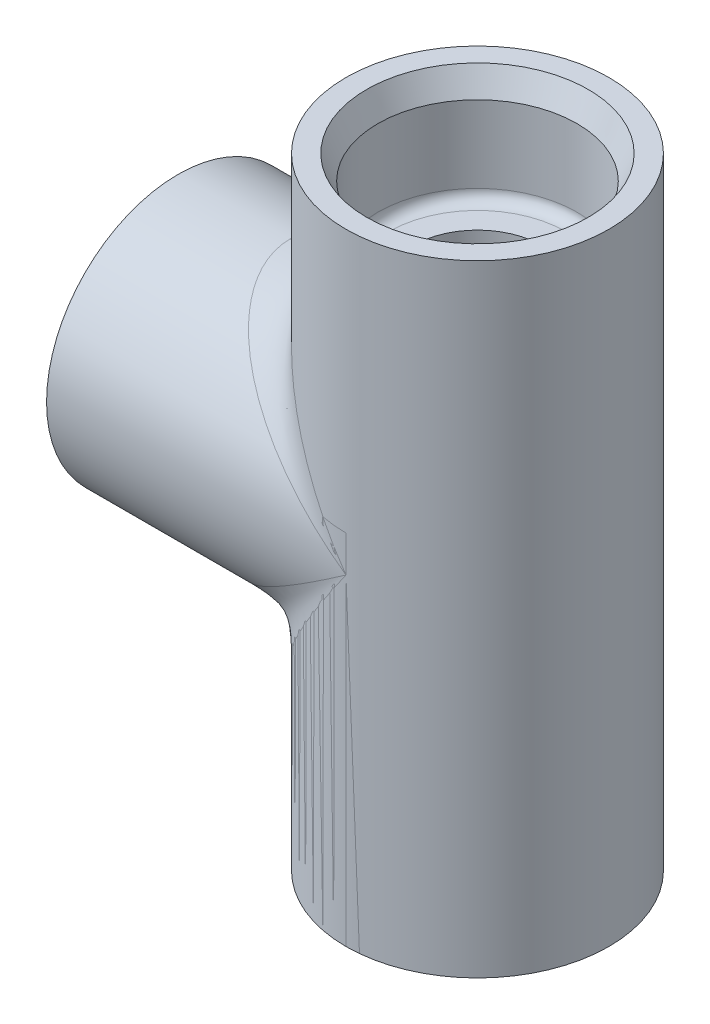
ISO-10303-21;
HEADER;
FILE_DESCRIPTION(('STEP AP214'),'2;1');
FILE_NAME('part.step','',(''),(''),'','','');
FILE_SCHEMA(('AUTOMOTIVE_DESIGN { 1 0 10303 214 1 1 1 1 }'));
ENDSEC;
DATA;
#1=APPLICATION_CONTEXT('core data for automotive mechanical design processes');
#2=APPLICATION_PROTOCOL_DEFINITION('international standard','automotive_design',2000,#1);
#3=PRODUCT_CONTEXT('',#1,'mechanical');
#4=PRODUCT('Part','Part','',(#3));
#5=PRODUCT_RELATED_PRODUCT_CATEGORY('part','',(#4));
#6=PRODUCT_DEFINITION_FORMATION('','',#4);
#7=PRODUCT_DEFINITION_CONTEXT('part definition',#1,'design');
#8=PRODUCT_DEFINITION('design','',#6,#7);
#9=PRODUCT_DEFINITION_SHAPE('','',#8);
#10=(LENGTH_UNIT() NAMED_UNIT(*) SI_UNIT(.MILLI.,.METRE.));
#11=(NAMED_UNIT(*) PLANE_ANGLE_UNIT() SI_UNIT($,.RADIAN.));
#12=(NAMED_UNIT(*) SI_UNIT($,.STERADIAN.) SOLID_ANGLE_UNIT());
#13=UNCERTAINTY_MEASURE_WITH_UNIT(LENGTH_MEASURE(1.E-05),#10,'distance_accuracy_value','');
#14=(GEOMETRIC_REPRESENTATION_CONTEXT(3) GLOBAL_UNCERTAINTY_ASSIGNED_CONTEXT((#13)) GLOBAL_UNIT_ASSIGNED_CONTEXT((#10,
#11,#12)) REPRESENTATION_CONTEXT('',''));
#15=CARTESIAN_POINT('',(0.,0.,0.));
#16=DIRECTION('',(0.,0.,1.));
#17=DIRECTION('',(1.,0.,0.));
#18=AXIS2_PLACEMENT_3D('',#15,#16,#17);
#19=CARTESIAN_POINT('',(0.,15.0000002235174,0.));
#20=DIRECTION('',(0.,-1.,0.));
#21=DIRECTION('',(0.,0.,-1.));
#22=AXIS2_PLACEMENT_3D('',#19,#20,#21);
#23=PLANE('',#22);
#24=CARTESIAN_POINT('',(9.75,15.0000002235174,0.));
#25=DIRECTION('',(0.,1.,0.));
#26=DIRECTION('',(1.,0.,0.));
#27=AXIS2_PLACEMENT_3D('',#24,#25,#26);
#28=CIRCLE('',#27,6.75);
#29=CARTESIAN_POINT('',(16.5,15.0000002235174,0.));
#30=VERTEX_POINT('',#29);
#31=EDGE_CURVE('P0_E182',#30,#30,#28,.T.);
#32=ORIENTED_EDGE('',*,*,#31,.T.);
#33=EDGE_LOOP('',(#32));
#34=FACE_BOUND('',#33,.T.);
#35=CARTESIAN_POINT('',(9.75,15.0000002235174,0.));
#36=DIRECTION('',(0.,-1.,0.));
#37=DIRECTION('',(0.,0.,-1.));
#38=AXIS2_PLACEMENT_3D('',#35,#36,#37);
#39=CIRCLE('',#38,9.75);
#40=CARTESIAN_POINT('',(9.75,15.0000002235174,-9.75));
#41=VERTEX_POINT('',#40);
#42=EDGE_CURVE('P0_E212',#41,#41,#39,.F.);
#43=ORIENTED_EDGE('',*,*,#42,.F.);
#44=EDGE_LOOP('',(#43));
#45=FACE_BOUND('',#44,.T.);
#46=ADVANCED_FACE('P0_F52',(#34,#45),#23,.T.);
#47=CARTESIAN_POINT('',(9.75,16.0000001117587,0.));
#48=DIRECTION('',(0.,1.,0.));
#49=DIRECTION('',(-1.,0.,0.));
#50=AXIS2_PLACEMENT_3D('',#47,#48,#49);
#51=CYLINDRICAL_SURFACE('',#50,11.75);
#52=DIRECTION('',(0.,-1.,0.));
#53=VECTOR('',#52,1.);
#54=CARTESIAN_POINT('',(21.5,39.5000001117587,0.));
#55=LINE('',#54,#53);
#56=CARTESIAN_POINT('',(21.5,55.5000002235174,0.));
#57=VERTEX_POINT('',#56);
#58=CARTESIAN_POINT('',(21.5,40.5000002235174,0.));
#59=VERTEX_POINT('',#58);
#60=EDGE_CURVE('P0_E196',#57,#59,#55,.T.);
#61=ORIENTED_EDGE('',*,*,#60,.T.);
#62=ORIENTED_EDGE('',*,*,#60,.F.);
#63=CARTESIAN_POINT('',(9.75,55.5000002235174,0.));
#64=DIRECTION('',(0.,1.,0.));
#65=DIRECTION('',(1.,0.,0.));
#66=AXIS2_PLACEMENT_3D('',#63,#64,#65);
#67=CIRCLE('',#66,11.75);
#68=EDGE_CURVE('P0_E193',#57,#57,#67,.T.);
#69=ORIENTED_EDGE('',*,*,#68,.F.);
#70=EDGE_LOOP('',(#61,#62,#69));
#71=FACE_BOUND('',#70,.T.);
#72=CARTESIAN_POINT('',(-2.,45.5000002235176,0.));
#73=CARTESIAN_POINT('',(-2.,45.5000002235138,-0.769044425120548));
#74=CARTESIAN_POINT('',(-1.92425846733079,45.3920282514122,-1.53805238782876));
#75=CARTESIAN_POINT('',(-1.62419562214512,44.9642790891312,-3.04657017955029));
#76=CARTESIAN_POINT('',(-1.39988172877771,44.6445124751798,-3.78603398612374));
#77=CARTESIAN_POINT('',(-0.81128728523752,43.8054523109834,-5.2070266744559));
#78=CARTESIAN_POINT('',(-0.447021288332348,43.2861795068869,-5.88852042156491));
#79=CARTESIAN_POINT('',(0.407485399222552,42.0680529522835,-7.16738005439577));
#80=CARTESIAN_POINT('',(0.897704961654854,41.3692293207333,-7.76471431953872));
#81=CARTESIAN_POINT('',(1.98528568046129,39.8188482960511,-8.85229503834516));
#82=CARTESIAN_POINT('',(2.58261994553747,38.9673292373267,-9.34251460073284));
#83=CARTESIAN_POINT('',(3.8614795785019,37.1442740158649,-10.197021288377));
#84=CARTESIAN_POINT('',(4.54297332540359,36.1727829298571,-10.5612872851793));
#85=CARTESIAN_POINT('',(6.67446235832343,33.1342772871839,-11.4441789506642));
#86=CARTESIAN_POINT('',(8.21165128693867,30.942965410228,-11.75));
#87=CARTESIAN_POINT('',(9.75,28.7500002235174,-11.75));
#88=(BOUNDED_CURVE() B_SPLINE_CURVE(3,(#72,#73,#74,#75,#76,#77,#78,#79,#80,#81,#82,#83,#84,#85,
#86,#87),.UNSPECIFIED.,.F.,.F.) B_SPLINE_CURVE_WITH_KNOTS((4,2,2,2,2,2,2,4),(0.,
0.196349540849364,0.392699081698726,0.589048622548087,0.785398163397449,0.981747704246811,
1.17809724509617,1.5707963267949),
.UNSPECIFIED.) CURVE() GEOMETRIC_REPRESENTATION_ITEM() RATIONAL_B_SPLINE_CURVE((1.,1.,1.,1.,1.,
1.,1.,1.,1.,1.,1.,1.,1.,1.,1.,1.)) REPRESENTATION_ITEM(''));
#89=CARTESIAN_POINT('',(9.75,28.7500002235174,-11.75));
#90=VERTEX_POINT('',#89);
#91=CARTESIAN_POINT('',(-2.,45.5000002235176,0.));
#92=VERTEX_POINT('',#91);
#93=EDGE_CURVE('P0_E73',#90,#92,#88,.F.);
#94=ORIENTED_EDGE('',*,*,#93,.T.);
#95=CARTESIAN_POINT('',(9.75,28.7500002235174,11.75));
#96=CARTESIAN_POINT('',(8.21165128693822,30.9429654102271,11.75));
#97=CARTESIAN_POINT('',(6.67446235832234,33.1342772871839,11.4441789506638));
#98=CARTESIAN_POINT('',(4.54297332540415,36.1727829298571,10.5612872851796));
#99=CARTESIAN_POINT('',(3.86147957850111,37.1442740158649,10.1970212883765));
#100=CARTESIAN_POINT('',(2.58261994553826,38.9673292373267,9.34251460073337));
#101=CARTESIAN_POINT('',(1.9852856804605,39.8188482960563,8.85229503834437));
#102=CARTESIAN_POINT('',(0.897704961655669,41.369229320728,7.76471431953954));
#103=CARTESIAN_POINT('',(0.407485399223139,42.0680529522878,7.16738005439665));
#104=CARTESIAN_POINT('',(-0.447021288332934,43.2861795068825,5.88852042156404));
#105=CARTESIAN_POINT('',(-0.81128728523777,43.8054523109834,5.2070266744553));
#106=CARTESIAN_POINT('',(-1.39988172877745,44.6445124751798,3.78603398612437));
#107=CARTESIAN_POINT('',(-1.62419562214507,44.9642790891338,3.04657017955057));
#108=CARTESIAN_POINT('',(-1.92425846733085,45.3920282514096,1.53805238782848));
#109=CARTESIAN_POINT('',(-2.,45.5000002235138,0.769044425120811));
#110=CARTESIAN_POINT('',(-2.,45.5000002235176,0.));
#111=(BOUNDED_CURVE() B_SPLINE_CURVE(3,(#95,#96,#97,#98,#99,#100,#101,#102,#103,#104,#105,#106,
#107,#108,#109,#110),.UNSPECIFIED.,.F.,.F.) B_SPLINE_CURVE_WITH_KNOTS((4,2,2,2,2,2,2,4),
(4.71238898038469,5.10508806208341,5.30143760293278,5.49778714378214,5.6941366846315,
5.89048622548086,6.08683576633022,6.28318530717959),
.UNSPECIFIED.) CURVE() GEOMETRIC_REPRESENTATION_ITEM() RATIONAL_B_SPLINE_CURVE((1.,1.,1.,1.,1.,
1.,1.,1.,1.,1.,1.,1.,1.,1.,1.,1.)) REPRESENTATION_ITEM(''));
#112=CARTESIAN_POINT('',(9.75,28.7500002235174,11.75));
#113=VERTEX_POINT('',#112);
#114=EDGE_CURVE('P0_E309',#92,#113,#111,.F.);
#115=ORIENTED_EDGE('',*,*,#114,.T.);
#116=CARTESIAN_POINT('',(9.75,28.7500002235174,-11.75));
#117=CARTESIAN_POINT('',(8.21165128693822,26.5570350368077,-11.75));
#118=CARTESIAN_POINT('',(6.67446235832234,24.365723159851,-11.4441789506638));
#119=CARTESIAN_POINT('',(4.54297332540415,21.3272175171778,-10.5612872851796));
#120=CARTESIAN_POINT('',(3.86147957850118,20.3557264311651,-10.1970212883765));
#121=CARTESIAN_POINT('',(2.58261994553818,18.5326712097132,-9.34251460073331));
#122=CARTESIAN_POINT('',(1.98528568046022,17.6811521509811,-8.85229503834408));
#123=CARTESIAN_POINT('',(0.897704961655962,16.1307711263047,-7.76471431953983));
#124=CARTESIAN_POINT('',(0.407485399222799,15.4319474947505,-7.16738005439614));
#125=CARTESIAN_POINT('',(-0.4470212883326,14.2138209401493,-5.88852042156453));
#126=CARTESIAN_POINT('',(-0.811287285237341,13.6945481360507,-5.20702667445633));
#127=CARTESIAN_POINT('',(-1.39988172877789,12.8554879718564,-3.78603398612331));
#128=CARTESIAN_POINT('',(-1.62419562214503,12.5357213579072,-3.04657017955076));
#129=CARTESIAN_POINT('',(-1.92425846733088,12.1079721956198,-1.53805238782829));
#130=CARTESIAN_POINT('',(-2.,12.0000002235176,-0.769035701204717));
#131=CARTESIAN_POINT('',(-2.,12.0000002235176,0.769035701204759));
#132=CARTESIAN_POINT('',(-1.9242584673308,12.1079721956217,1.53805238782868));
#133=CARTESIAN_POINT('',(-1.62419562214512,12.5357213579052,3.04657017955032));
#134=CARTESIAN_POINT('',(-1.39988172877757,12.8554879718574,3.78603398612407));
#135=CARTESIAN_POINT('',(-0.811287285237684,13.6945481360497,5.20702667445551));
#136=CARTESIAN_POINT('',(-0.447021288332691,14.2138209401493,5.8885204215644));
#137=CARTESIAN_POINT('',(0.407485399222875,15.4319474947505,7.16738005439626));
#138=CARTESIAN_POINT('',(0.897704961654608,16.1307711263,7.76471431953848));
#139=CARTESIAN_POINT('',(1.98528568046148,17.6811521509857,8.85229503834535));
#140=CARTESIAN_POINT('',(2.58261994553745,18.5326712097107,9.34251460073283));
#141=CARTESIAN_POINT('',(3.86147957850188,20.3557264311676,10.197021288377));
#142=CARTESIAN_POINT('',(4.54297332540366,21.3272175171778,10.5612872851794));
#143=CARTESIAN_POINT('',(6.67446235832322,24.365723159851,11.4441789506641));
#144=CARTESIAN_POINT('',(8.21165128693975,26.5570350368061,11.75));
#145=CARTESIAN_POINT('',(9.75000000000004,28.7500002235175,11.75));
#146=(BOUNDED_CURVE() B_SPLINE_CURVE(3,(#116,#117,#118,#119,#120,#121,#122,#123,#124,#125,#126,
#127,#128,#129,#130,#131,#132,#133,#134,#135,#136,#137,#138,#139,#140,#141,#142,#143,#144,#145),
.UNSPECIFIED.,.F.,.F.) B_SPLINE_CURVE_WITH_KNOTS((4,2,2,2,2,2,2,2,2,2,2,2,2,2,4),
(4.71238898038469,5.10508806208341,5.30143760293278,5.49778714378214,5.6941366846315,
5.89048622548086,6.08683576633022,6.28318530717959,6.47953484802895,6.67588438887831,
6.87223392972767,7.06858347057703,7.2649330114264,7.46128255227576,7.85398163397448),
.UNSPECIFIED.) CURVE() GEOMETRIC_REPRESENTATION_ITEM() RATIONAL_B_SPLINE_CURVE((1.,1.,1.,1.,1.,
1.,1.,1.,1.,1.,1.,1.,1.,1.,1.,1.,1.,1.,1.,1.,1.,1.,1.,1.,1.,1.,1.,1.,1.,1.)) REPRESENTATION_ITEM(''));
#147=EDGE_CURVE('P0_E279',#113,#90,#146,.F.);
#148=ORIENTED_EDGE('',*,*,#147,.T.);
#149=EDGE_LOOP('',(#94,#115,#148));
#150=FACE_BOUND('',#149,.T.);
#151=DIRECTION('',(0.,-1.,0.));
#152=VECTOR('',#151,1.);
#153=CARTESIAN_POINT('',(21.5,16.0000001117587,0.));
#154=LINE('',#153,#152);
#155=CARTESIAN_POINT('',(21.5,17.0000002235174,0.));
#156=VERTEX_POINT('',#155);
#157=CARTESIAN_POINT('',(21.5,15.0000002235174,0.));
#158=VERTEX_POINT('',#157);
#159=EDGE_CURVE('P0_E173',#156,#158,#154,.T.);
#160=ORIENTED_EDGE('',*,*,#159,.T.);
#161=ORIENTED_EDGE('',*,*,#159,.F.);
#162=EDGE_LOOP('',(#160,#161));
#163=FACE_BOUND('',#162,.T.);
#164=CARTESIAN_POINT('',(9.75,0.,0.));
#165=DIRECTION('',(0.,-1.,0.));
#166=DIRECTION('',(0.,0.,-1.));
#167=AXIS2_PLACEMENT_3D('',#164,#165,#166);
#168=CIRCLE('',#167,11.75);
#169=CARTESIAN_POINT('',(9.75,0.,-11.75));
#170=VERTEX_POINT('',#169);
#171=EDGE_CURVE('P0_E888',#170,#170,#168,.T.);
#172=ORIENTED_EDGE('',*,*,#171,.F.);
#173=EDGE_LOOP('',(#172));
#174=FACE_BOUND('',#173,.T.);
#175=ADVANCED_FACE('P0_F174',(#71,#150,#163,#174),#51,.T.);
#176=CARTESIAN_POINT('',(-0.999999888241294,28.7500002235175,0.));
#177=DIRECTION('',(-1.,0.,0.));
#178=DIRECTION('',(0.,-1.,0.));
#179=AXIS2_PLACEMENT_3D('',#176,#177,#178);
#180=CYLINDRICAL_SURFACE('',#179,11.75);
#181=CARTESIAN_POINT('',(9.75000000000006,28.7500002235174,11.75));
#182=CARTESIAN_POINT('',(7.55703481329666,27.2116515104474,11.75));
#183=CARTESIAN_POINT('',(5.36572293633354,25.6744625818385,11.4441789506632));
#184=CARTESIAN_POINT('',(2.32721729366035,23.5429735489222,10.5612872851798));
#185=CARTESIAN_POINT('',(1.35572620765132,22.8614798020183,10.1970212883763));
#186=CARTESIAN_POINT('',(-0.467329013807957,21.582620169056,9.34251460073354));
#187=CARTESIAN_POINT('',(-1.318848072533,20.9852859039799,8.85229503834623));
#188=CARTESIAN_POINT('',(-2.86922909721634,19.8977051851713,7.7647143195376));
#189=CARTESIAN_POINT('',(-3.56805272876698,19.4074856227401,7.16738005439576));
#190=CARTESIAN_POINT('',(-4.7861792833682,18.5529789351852,5.8885204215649));
#191=CARTESIAN_POINT('',(-5.30545208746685,18.1887129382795,5.20702667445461));
#192=CARTESIAN_POINT('',(-6.14451225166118,17.6001184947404,3.78603398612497));
#193=CARTESIAN_POINT('',(-6.46427886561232,17.3758046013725,3.04657017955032));
#194=CARTESIAN_POINT('',(-6.89202802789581,17.0757417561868,1.53805238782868));
#195=CARTESIAN_POINT('',(-6.99999999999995,17.0000002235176,0.769035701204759));
#196=CARTESIAN_POINT('',(-6.99999999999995,17.0000002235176,-0.769035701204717));
#197=CARTESIAN_POINT('',(-6.89202802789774,17.0757417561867,-1.53805238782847));
#198=CARTESIAN_POINT('',(-6.46427886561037,17.3758046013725,-3.04657017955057));
#199=CARTESIAN_POINT('',(-6.14451225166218,17.6001184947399,-3.78603398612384));
#200=CARTESIAN_POINT('',(-5.30545208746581,18.18871293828,-5.2070266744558));
#201=CARTESIAN_POINT('',(-4.78617928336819,18.5529789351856,-5.88852042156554));
#202=CARTESIAN_POINT('',(-3.56805272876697,19.4074856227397,-7.16738005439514));
#203=CARTESIAN_POINT('',(-2.86922909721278,19.8977051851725,-7.76471431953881));
#204=CARTESIAN_POINT('',(-1.31884807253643,20.9852859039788,-8.8522950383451));
#205=CARTESIAN_POINT('',(-0.467329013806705,21.5826201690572,-9.34251460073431));
#206=CARTESIAN_POINT('',(1.3557262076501,22.8614798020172,-10.1970212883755));
#207=CARTESIAN_POINT('',(2.32721729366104,23.5429735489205,-10.5612872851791));
#208=CARTESIAN_POINT('',(5.36572293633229,25.674462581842,-11.4441789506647));
#209=CARTESIAN_POINT('',(7.55703481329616,27.2116515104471,-11.75));
#210=CARTESIAN_POINT('',(9.75,28.7500002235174,-11.75));
#211=(BOUNDED_CURVE() B_SPLINE_CURVE(3,(#181,#182,#183,#184,#185,#186,#187,#188,#189,#190,#191,
#192,#193,#194,#195,#196,#197,#198,#199,#200,#201,#202,#203,#204,#205,#206,#207,#208,#209,#210),
.UNSPECIFIED.,.F.,.F.) B_SPLINE_CURVE_WITH_KNOTS((4,2,2,2,2,2,2,2,2,2,2,2,2,2,4),
(4.71238898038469,5.10508806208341,5.30143760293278,5.49778714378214,5.6941366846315,
5.89048622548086,6.08683576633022,6.28318530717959,6.47953484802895,6.67588438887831,
6.87223392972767,7.06858347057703,7.2649330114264,7.46128255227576,7.85398163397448),
.UNSPECIFIED.) CURVE() GEOMETRIC_REPRESENTATION_ITEM() RATIONAL_B_SPLINE_CURVE((1.,1.,1.,1.,1.,
1.,1.,1.,1.,1.,1.,1.,1.,1.,1.,1.,1.,1.,1.,1.,1.,1.,1.,1.,1.,1.,1.,1.,1.,1.)) REPRESENTATION_ITEM(''));
#212=EDGE_CURVE('P0_E237',#90,#113,#211,.F.);
#213=ORIENTED_EDGE('',*,*,#212,.T.);
#214=CARTESIAN_POINT('',(-7.00000000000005,40.5000002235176,0.));
#215=CARTESIAN_POINT('',(-6.99999999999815,40.5000002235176,0.769044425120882));
#216=CARTESIAN_POINT('',(-6.89202802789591,40.4242586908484,1.53805238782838));
#217=CARTESIAN_POINT('',(-6.46427886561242,40.1241958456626,3.04657017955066));
#218=CARTESIAN_POINT('',(-6.14451225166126,39.8998819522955,3.78603398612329));
#219=CARTESIAN_POINT('',(-5.30545208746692,39.3112875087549,5.20702667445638));
#220=CARTESIAN_POINT('',(-4.78617928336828,38.9470215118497,5.88852042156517));
#221=CARTESIAN_POINT('',(-3.56805272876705,38.0925148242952,7.16738005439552));
#222=CARTESIAN_POINT('',(-2.86922909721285,37.6022952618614,7.76471431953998));
#223=CARTESIAN_POINT('',(-1.3188480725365,36.5147145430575,8.85229503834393));
#224=CARTESIAN_POINT('',(-0.467329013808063,35.9173802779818,9.34251460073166));
#225=CARTESIAN_POINT('',(1.35572620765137,34.6385206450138,10.1970212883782));
#226=CARTESIAN_POINT('',(2.327217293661,33.9570268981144,10.5612872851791));
#227=CARTESIAN_POINT('',(5.36572293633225,31.8255378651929,11.4441789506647));
#228=CARTESIAN_POINT('',(7.55703481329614,30.2883489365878,11.75));
#229=CARTESIAN_POINT('',(9.75,28.7500002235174,11.75));
#230=(BOUNDED_CURVE() B_SPLINE_CURVE(3,(#214,#215,#216,#217,#218,#219,#220,#221,#222,#223,#224,
#225,#226,#227,#228,#229),.UNSPECIFIED.,.F.,.F.) B_SPLINE_CURVE_WITH_KNOTS((4,2,2,2,2,2,2,4),
(4.71238898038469,4.90873852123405,5.10508806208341,5.30143760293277,5.49778714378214,
5.6941366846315,5.89048622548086,6.28318530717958),
.UNSPECIFIED.) CURVE() GEOMETRIC_REPRESENTATION_ITEM() RATIONAL_B_SPLINE_CURVE((1.,1.,1.,1.,1.,
1.,1.,1.,1.,1.,1.,1.,1.,1.,1.,1.)) REPRESENTATION_ITEM(''));
#231=CARTESIAN_POINT('',(-7.00000000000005,40.5000002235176,0.));
#232=VERTEX_POINT('',#231);
#233=EDGE_CURVE('P0_E269',#113,#232,#230,.F.);
#234=ORIENTED_EDGE('',*,*,#233,.T.);
#235=DIRECTION('',(1.,0.,0.));
#236=VECTOR('',#235,1.);
#237=CARTESIAN_POINT('',(-0.999999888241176,40.5000002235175,0.));
#238=LINE('',#237,#236);
#239=CARTESIAN_POINT('',(-16.9999999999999,40.5000002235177,0.));
#240=VERTEX_POINT('',#239);
#241=EDGE_CURVE('P0_E221',#240,#232,#238,.T.);
#242=ORIENTED_EDGE('',*,*,#241,.F.);
#243=CARTESIAN_POINT('',(-17.,28.7500002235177,0.));
#244=DIRECTION('',(-1.,0.,0.));
#245=DIRECTION('',(0.,1.,0.));
#246=AXIS2_PLACEMENT_3D('',#243,#244,#245);
#247=CIRCLE('',#246,11.75);
#248=EDGE_CURVE('P0_E222',#240,#240,#247,.T.);
#249=ORIENTED_EDGE('',*,*,#248,.F.);
#250=ORIENTED_EDGE('',*,*,#241,.T.);
#251=CARTESIAN_POINT('',(9.75,28.7500002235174,-11.75));
#252=CARTESIAN_POINT('',(7.55703481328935,30.2883489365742,-11.75));
#253=CARTESIAN_POINT('',(5.36572293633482,31.8255378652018,-11.444178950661));
#254=CARTESIAN_POINT('',(2.3272172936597,33.95702689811,-10.5612872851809));
#255=CARTESIAN_POINT('',(1.35572620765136,34.6385206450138,-10.1970212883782));
#256=CARTESIAN_POINT('',(-0.467329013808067,35.9173802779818,-9.34251460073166));
#257=CARTESIAN_POINT('',(-1.31884807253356,36.5147145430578,-8.85229503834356));
#258=CARTESIAN_POINT('',(-2.86922909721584,37.6022952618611,-7.76471431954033));
#259=CARTESIAN_POINT('',(-3.56805272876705,38.0925148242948,-7.16738005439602));
#260=CARTESIAN_POINT('',(-4.78617928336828,38.9470215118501,-5.88852042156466));
#261=CARTESIAN_POINT('',(-5.30545208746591,39.3112875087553,-5.20702667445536));
#262=CARTESIAN_POINT('',(-6.14451225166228,39.8998819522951,-3.78603398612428));
#263=CARTESIAN_POINT('',(-6.46427886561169,40.1241958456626,-3.04657017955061));
#264=CARTESIAN_POINT('',(-6.89202802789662,40.4242586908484,-1.53805238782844));
#265=CARTESIAN_POINT('',(-6.99999999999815,40.5000002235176,-0.769044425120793));
#266=CARTESIAN_POINT('',(-7.00000000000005,40.5000002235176,0.));
#267=(BOUNDED_CURVE() B_SPLINE_CURVE(3,(#251,#252,#253,#254,#255,#256,#257,#258,#259,#260,#261,
#262,#263,#264,#265,#266),.UNSPECIFIED.,.F.,.F.) B_SPLINE_CURVE_WITH_KNOTS((4,2,2,2,2,2,2,4),
(0.,0.392699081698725,0.589048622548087,0.785398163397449,0.981747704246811,1.17809724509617,
1.37444678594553,1.5707963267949),
.UNSPECIFIED.) CURVE() GEOMETRIC_REPRESENTATION_ITEM() RATIONAL_B_SPLINE_CURVE((1.,1.,1.,1.,1.,
1.,1.,1.,1.,1.,1.,1.,1.,1.,1.,1.)) REPRESENTATION_ITEM(''));
#268=EDGE_CURVE('P0_E437',#232,#90,#267,.F.);
#269=ORIENTED_EDGE('',*,*,#268,.T.);
#270=EDGE_LOOP('',(#213,#234,#242,#249,#250,#269));
#271=FACE_BOUND('',#270,.T.);
#272=ADVANCED_FACE('P0_F243',(#271),#180,.T.);
#273=CARTESIAN_POINT('',(7.35489156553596,28.7500002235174,0.));
#274=DIRECTION('',(-1.,0.,0.));
#275=DIRECTION('',(0.,-1.,0.));
#276=AXIS2_PLACEMENT_3D('',#273,#274,#275);
#277=CYLINDRICAL_SURFACE('',#276,5.74999994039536);
#278=DIRECTION('',(1.,0.,0.));
#279=VECTOR('',#278,1.);
#280=CARTESIAN_POINT('',(7.35489156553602,34.5000001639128,0.));
#281=LINE('',#280,#279);
#282=CARTESIAN_POINT('',(-6.99999999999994,34.500000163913,0.));
#283=VERTEX_POINT('',#282);
#284=CARTESIAN_POINT('',(-1.99999999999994,34.5000001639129,0.));
#285=VERTEX_POINT('',#284);
#286=EDGE_CURVE('P0_E217',#283,#285,#281,.T.);
#287=ORIENTED_EDGE('',*,*,#286,.T.);
#288=ORIENTED_EDGE('',*,*,#286,.F.);
#289=CARTESIAN_POINT('',(-6.99999999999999,28.7500002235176,0.));
#290=DIRECTION('',(-1.,0.,0.));
#291=DIRECTION('',(0.,1.,0.));
#292=AXIS2_PLACEMENT_3D('',#289,#290,#291);
#293=CIRCLE('',#292,5.7499999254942);
#294=EDGE_CURVE('P0_E214',#283,#283,#293,.T.);
#295=ORIENTED_EDGE('',*,*,#294,.T.);
#296=EDGE_LOOP('',(#287,#288,#295));
#297=FACE_BOUND('',#296,.T.);
#298=CARTESIAN_POINT('',(9.75000000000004,28.7500002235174,5.74999994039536));
#299=CARTESIAN_POINT('',(8.34257458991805,29.5028091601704,5.74999994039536));
#300=CARTESIAN_POINT('',(6.93621025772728,30.2550505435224,5.60034283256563));
#301=CARTESIAN_POINT('',(4.33609599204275,31.6458093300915,5.02427168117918));
#302=CARTESIAN_POINT('',(3.14362279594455,32.2836438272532,4.59808429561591));
#303=CARTESIAN_POINT('',(1.65109181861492,33.0819743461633,3.79975377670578));
#304=CARTESIAN_POINT('',(1.20259307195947,33.3218690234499,3.5074412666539));
#305=CARTESIAN_POINT('',(0.420810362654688,33.7400318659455,2.88161634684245));
#306=CARTESIAN_POINT('',(0.0875457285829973,33.9182896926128,2.54811940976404));
#307=CARTESIAN_POINT('',(-0.450955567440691,34.206325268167,1.85274001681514));
#308=CARTESIAN_POINT('',(-0.656178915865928,34.3160958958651,1.49087475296));
#309=CARTESIAN_POINT('',(-0.930704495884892,34.4629351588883,0.752663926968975));
#310=CARTESIAN_POINT('',(-0.999999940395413,34.5000001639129,0.37633661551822));
#311=CARTESIAN_POINT('',(-0.999999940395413,34.5000001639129,-0.376336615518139));
#312=CARTESIAN_POINT('',(-0.930704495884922,34.4629351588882,-0.752663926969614));
#313=CARTESIAN_POINT('',(-0.656178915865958,34.3160958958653,-1.4908747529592));
#314=CARTESIAN_POINT('',(-0.450955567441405,34.2063252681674,-1.85274001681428));
#315=CARTESIAN_POINT('',(0.0875457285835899,33.9182896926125,-2.54811940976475));
#316=CARTESIAN_POINT('',(0.420810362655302,33.7400318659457,-2.88161634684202));
#317=CARTESIAN_POINT('',(1.20259307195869,33.3218690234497,-3.5074412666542));
#318=CARTESIAN_POINT('',(1.65109181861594,33.0819743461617,-3.79975377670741));
#319=CARTESIAN_POINT('',(3.14362279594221,32.2836438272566,-4.5980842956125));
#320=CARTESIAN_POINT('',(4.33609599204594,31.6458093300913,-5.02427168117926));
#321=CARTESIAN_POINT('',(6.93621025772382,30.2550505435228,-5.60034283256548));
#322=CARTESIAN_POINT('',(8.34257458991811,29.502809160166,-5.74999994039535));
#323=CARTESIAN_POINT('',(9.74999999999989,28.7500002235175,-5.74999994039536));
#324=(BOUNDED_CURVE() B_SPLINE_CURVE(3,(#298,#299,#300,#301,#302,#303,#304,#305,#306,#307,#308,
#309,#310,#311,#312,#313,#314,#315,#316,#317,#318,#319,#320,#321,#322,#323),.UNSPECIFIED.,.F.,
.F.) B_SPLINE_CURVE_WITH_KNOTS((4,2,2,2,2,2,2,2,2,2,2,2,4),(-1.57079632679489,-1.17809724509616,
-0.785398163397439,-0.589048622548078,-0.392699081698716,-0.196349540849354,0.,
0.196349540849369,0.392699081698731,0.589048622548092,0.785398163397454,1.17809724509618,
1.5707963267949),
.UNSPECIFIED.) CURVE() GEOMETRIC_REPRESENTATION_ITEM() RATIONAL_B_SPLINE_CURVE((1.,1.,1.,1.,1.,
1.,1.,1.,1.,1.,1.,1.,1.,1.,1.,1.,1.,1.,1.,1.,1.,1.,1.,1.,1.,1.)) REPRESENTATION_ITEM(''));
#325=CARTESIAN_POINT('',(9.74999999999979,28.7500002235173,-5.74999994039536));
#326=VERTEX_POINT('',#325);
#327=CARTESIAN_POINT('',(9.75000000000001,28.7500002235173,5.74999994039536));
#328=VERTEX_POINT('',#327);
#329=EDGE_CURVE('P0_E66',#326,#328,#324,.F.);
#330=ORIENTED_EDGE('',*,*,#329,.T.);
#331=CARTESIAN_POINT('',(9.74999999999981,28.7500002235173,-5.74999994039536));
#332=CARTESIAN_POINT('',(8.34257458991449,27.9971912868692,-5.74999994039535));
#333=CARTESIAN_POINT('',(6.93621025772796,27.2449499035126,-5.60034283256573));
#334=CARTESIAN_POINT('',(4.33609599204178,25.854191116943,-5.02427168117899));
#335=CARTESIAN_POINT('',(3.143622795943,25.2163566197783,-4.59808429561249));
#336=CARTESIAN_POINT('',(1.65109181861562,24.4180261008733,-3.79975377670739));
#337=CARTESIAN_POINT('',(1.20259307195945,24.1781314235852,-3.50744126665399));
#338=CARTESIAN_POINT('',(0.420810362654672,23.7599685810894,-2.8816163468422));
#339=CARTESIAN_POINT('',(0.087545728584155,23.5817107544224,-2.54811940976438));
#340=CARTESIAN_POINT('',(-0.4509555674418,23.2936751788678,-1.85274001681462));
#341=CARTESIAN_POINT('',(-0.656178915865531,23.18390455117,-1.49087475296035));
#342=CARTESIAN_POINT('',(-0.930704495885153,23.0370652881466,-0.752663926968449));
#343=CARTESIAN_POINT('',(-0.999999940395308,23.0000002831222,-0.376336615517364));
#344=CARTESIAN_POINT('',(-0.999999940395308,23.0000002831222,0.376336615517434));
#345=CARTESIAN_POINT('',(-0.93070449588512,23.0370652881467,0.752663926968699));
#346=CARTESIAN_POINT('',(-0.656178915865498,23.1839045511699,1.49087475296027));
#347=CARTESIAN_POINT('',(-0.450955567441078,23.2936751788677,1.85274001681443));
#348=CARTESIAN_POINT('',(0.087545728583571,23.5817107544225,2.54811940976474));
#349=CARTESIAN_POINT('',(0.420810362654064,23.7599685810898,2.8816163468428));
#350=CARTESIAN_POINT('',(1.20259307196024,24.1781314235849,3.50744126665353));
#351=CARTESIAN_POINT('',(1.65109181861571,24.4180261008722,3.79975377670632));
#352=CARTESIAN_POINT('',(3.14362279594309,25.2163566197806,4.59808429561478));
#353=CARTESIAN_POINT('',(4.33609599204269,25.854191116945,5.02427168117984));
#354=CARTESIAN_POINT('',(6.93621025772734,27.2449499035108,5.60034283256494));
#355=CARTESIAN_POINT('',(8.34257458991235,27.9971912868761,5.74999994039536));
#356=CARTESIAN_POINT('',(9.74999999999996,28.7500002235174,5.74999994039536));
#357=(BOUNDED_CURVE() B_SPLINE_CURVE(3,(#331,#332,#333,#334,#335,#336,#337,#338,#339,#340,#341,
#342,#343,#344,#345,#346,#347,#348,#349,#350,#351,#352,#353,#354,#355,#356),.UNSPECIFIED.,.F.,
.F.) B_SPLINE_CURVE_WITH_KNOTS((4,2,2,2,2,2,2,2,2,2,2,2,4),(1.57079632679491,1.96349540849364,
2.35619449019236,2.55254403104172,2.74889357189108,2.94524311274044,3.1415926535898,
3.33794219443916,3.53429173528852,3.73064127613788,3.92699081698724,4.31968989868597,
4.71238898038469),
.UNSPECIFIED.) CURVE() GEOMETRIC_REPRESENTATION_ITEM() RATIONAL_B_SPLINE_CURVE((1.,1.,1.,1.,1.,
1.,1.,1.,1.,1.,1.,1.,1.,1.,1.,1.,1.,1.,1.,1.,1.,1.,1.,1.,1.,1.)) REPRESENTATION_ITEM(''));
#358=EDGE_CURVE('P0_E14',#328,#326,#357,.F.);
#359=ORIENTED_EDGE('',*,*,#358,.T.);
#360=EDGE_LOOP('',(#330,#359));
#361=FACE_BOUND('',#360,.T.);
#362=ADVANCED_FACE('P0_F253',(#297,#361),#277,.F.);
#363=CARTESIAN_POINT('',(-12.25,28.7500002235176,0.));
#364=DIRECTION('',(-1.,0.,0.));
#365=DIRECTION('',(0.,-1.,0.));
#366=AXIS2_PLACEMENT_3D('',#363,#364,#365);
#367=CYLINDRICAL_SURFACE('',#366,8.8999999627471);
#368=DIRECTION('',(1.,0.,0.));
#369=VECTOR('',#368,1.);
#370=CARTESIAN_POINT('',(-12.2499999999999,37.6500001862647,0.));
#371=LINE('',#370,#369);
#372=CARTESIAN_POINT('',(-14.8554930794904,37.6500001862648,0.));
#373=VERTEX_POINT('',#372);
#374=CARTESIAN_POINT('',(-7.9999999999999,37.6500001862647,0.));
#375=VERTEX_POINT('',#374);
#376=EDGE_CURVE('P0_E203',#373,#375,#371,.T.);
#377=ORIENTED_EDGE('',*,*,#376,.F.);
#378=CARTESIAN_POINT('',(-14.8554930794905,28.7500002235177,0.));
#379=DIRECTION('',(-1.,0.,0.));
#380=DIRECTION('',(0.,0.,1.));
#381=AXIS2_PLACEMENT_3D('',#378,#379,#380);
#382=CIRCLE('',#381,8.8999999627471);
#383=EDGE_CURVE('P0_E180',#373,#373,#382,.T.);
#384=ORIENTED_EDGE('',*,*,#383,.T.);
#385=ORIENTED_EDGE('',*,*,#376,.T.);
#386=CARTESIAN_POINT('',(-7.99999999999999,28.7500002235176,0.));
#387=DIRECTION('',(-1.,0.,0.));
#388=DIRECTION('',(0.,1.,0.));
#389=AXIS2_PLACEMENT_3D('',#386,#387,#388);
#390=CIRCLE('',#389,8.8999999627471);
#391=CARTESIAN_POINT('',(-7.99999999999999,28.7500002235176,-8.8999999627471));
#392=VERTEX_POINT('',#391);
#393=EDGE_CURVE('P0_E209',#392,#375,#390,.T.);
#394=ORIENTED_EDGE('',*,*,#393,.F.);
#395=CARTESIAN_POINT('',(-7.99999999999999,28.7500002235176,0.));
#396=DIRECTION('',(-1.,0.,0.));
#397=DIRECTION('',(0.,1.,0.));
#398=AXIS2_PLACEMENT_3D('',#395,#396,#397);
#399=CIRCLE('',#398,8.8999999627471);
#400=EDGE_CURVE('P0_E207',#375,#392,#399,.T.);
#401=ORIENTED_EDGE('',*,*,#400,.F.);
#402=EDGE_LOOP('',(#377,#384,#385,#394,#401));
#403=FACE_BOUND('',#402,.T.);
#404=ADVANCED_FACE('P0_F546',(#403),#367,.F.);
#405=CARTESIAN_POINT('',(-17.0000000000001,19.3500002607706,0.));
#406=DIRECTION('',(-1.,0.,0.));
#407=DIRECTION('',(0.,1.,0.));
#408=AXIS2_PLACEMENT_3D('',#405,#406,#407);
#409=PLANE('',#408);
#410=CARTESIAN_POINT('',(-17.,28.7500002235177,0.));
#411=DIRECTION('',(-1.,0.,0.));
#412=DIRECTION('',(0.,0.,1.));
#413=AXIS2_PLACEMENT_3D('',#410,#411,#412);
#414=CIRCLE('',#413,9.8999999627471);
#415=CARTESIAN_POINT('',(-17.,28.7500002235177,9.8999999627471));
#416=VERTEX_POINT('',#415);
#417=EDGE_CURVE('P0_E176',#416,#416,#414,.F.);
#418=ORIENTED_EDGE('',*,*,#417,.T.);
#419=EDGE_LOOP('',(#418));
#420=FACE_BOUND('',#419,.T.);
#421=ORIENTED_EDGE('',*,*,#248,.T.);
#422=EDGE_LOOP('',(#421));
#423=FACE_BOUND('',#422,.T.);
#424=ADVANCED_FACE('P0_F254',(#420,#423),#409,.T.);
#425=CARTESIAN_POINT('',(-7.00000000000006,23.0000002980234,0.));
#426=DIRECTION('',(-1.,0.,0.));
#427=DIRECTION('',(0.,1.,0.));
#428=AXIS2_PLACEMENT_3D('',#425,#426,#427);
#429=PLANE('',#428);
#430=ORIENTED_EDGE('',*,*,#294,.F.);
#431=EDGE_LOOP('',(#430));
#432=FACE_BOUND('',#431,.T.);
#433=CARTESIAN_POINT('',(-6.99999999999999,28.7500002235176,0.));
#434=DIRECTION('',(-1.,0.,0.));
#435=DIRECTION('',(0.,1.,0.));
#436=AXIS2_PLACEMENT_3D('',#433,#434,#435);
#437=CIRCLE('',#436,7.8999999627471);
#438=CARTESIAN_POINT('',(-6.99999999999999,28.7500002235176,-7.8999999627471));
#439=VERTEX_POINT('',#438);
#440=EDGE_CURVE('P0_E208',#439,#439,#437,.T.);
#441=ORIENTED_EDGE('',*,*,#440,.T.);
#442=EDGE_LOOP('',(#441));
#443=FACE_BOUND('',#442,.T.);
#444=ADVANCED_FACE('P0_F540',(#432,#443),#429,.T.);
#445=CARTESIAN_POINT('',(-7.99999999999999,28.7500002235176,0.));
#446=DIRECTION('',(-1.,0.,0.));
#447=DIRECTION('',(0.,0.,1.));
#448=AXIS2_PLACEMENT_3D('',#445,#446,#447);
#449=TOROIDAL_SURFACE('',#448,7.89999996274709,1.);
#450=ORIENTED_EDGE('',*,*,#393,.T.);
#451=ORIENTED_EDGE('',*,*,#400,.T.);
#452=CARTESIAN_POINT('',(-7.99999999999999,28.7500002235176,-7.89999996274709));
#453=DIRECTION('',(0.,-1.,0.));
#454=DIRECTION('',(0.,0.,-1.));
#455=AXIS2_PLACEMENT_3D('',#452,#453,#454);
#456=CIRCLE('',#455,1.);
#457=EDGE_CURVE('P0_E204',#392,#439,#456,.T.);
#458=ORIENTED_EDGE('',*,*,#457,.T.);
#459=ORIENTED_EDGE('',*,*,#440,.F.);
#460=ORIENTED_EDGE('',*,*,#457,.F.);
#461=EDGE_LOOP('',(#450,#451,#458,#459,#460));
#462=FACE_BOUND('',#461,.T.);
#463=ADVANCED_FACE('P0_F538',(#462),#449,.F.);
#464=CARTESIAN_POINT('',(-14.8554930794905,28.7500002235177,0.));
#465=DIRECTION('',(-1.,0.,0.));
#466=DIRECTION('',(0.,0.,1.));
#467=AXIS2_PLACEMENT_3D('',#464,#465,#466);
#468=CONICAL_SURFACE('',#467,8.8999999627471,0.436332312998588);
#469=ORIENTED_EDGE('',*,*,#417,.F.);
#470=EDGE_LOOP('',(#469));
#471=FACE_BOUND('',#470,.T.);
#472=ORIENTED_EDGE('',*,*,#383,.F.);
#473=EDGE_LOOP('',(#472));
#474=FACE_BOUND('',#473,.T.);
#475=ADVANCED_FACE('P0_F342',(#471,#474),#468,.F.);
#476=CARTESIAN_POINT('',(3.,11.0000001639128,0.));
#477=DIRECTION('',(0.,1.,0.));
#478=DIRECTION('',(1.,0.,0.));
#479=AXIS2_PLACEMENT_3D('',#476,#477,#478);
#480=PLANE('',#479);
#481=CARTESIAN_POINT('',(9.75,11.0000001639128,0.));
#482=DIRECTION('',(0.,1.,0.));
#483=DIRECTION('',(1.,0.,0.));
#484=AXIS2_PLACEMENT_3D('',#481,#482,#483);
#485=CIRCLE('',#484,6.75);
#486=CARTESIAN_POINT('',(16.5,11.0000001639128,0.));
#487=VERTEX_POINT('',#486);
#488=EDGE_CURVE('P0_E824',#487,#487,#485,.T.);
#489=ORIENTED_EDGE('',*,*,#488,.F.);
#490=EDGE_LOOP('',(#489));
#491=FACE_BOUND('',#490,.T.);
#492=CARTESIAN_POINT('',(9.75,11.0000001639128,0.));
#493=DIRECTION('',(0.,1.,0.));
#494=DIRECTION('',(1.,0.,0.));
#495=AXIS2_PLACEMENT_3D('',#492,#493,#494);
#496=CIRCLE('',#495,7.74999997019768);
#497=CARTESIAN_POINT('',(17.4999999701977,11.0000001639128,0.));
#498=VERTEX_POINT('',#497);
#499=EDGE_CURVE('P0_E827',#498,#498,#496,.T.);
#500=ORIENTED_EDGE('',*,*,#499,.T.);
#501=EDGE_LOOP('',(#500));
#502=FACE_BOUND('',#501,.T.);
#503=ADVANCED_FACE('P0_F537',(#491,#502),#480,.T.);
#504=CARTESIAN_POINT('',(9.75,13.0000001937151,0.));
#505=DIRECTION('',(0.,1.,0.));
#506=DIRECTION('',(-1.,0.,0.));
#507=AXIS2_PLACEMENT_3D('',#504,#505,#506);
#508=CYLINDRICAL_SURFACE('',#507,6.75);
#509=ORIENTED_EDGE('',*,*,#31,.F.);
#510=DIRECTION('',(0.,-1.,0.));
#511=VECTOR('',#510,1.);
#512=CARTESIAN_POINT('',(16.5,13.0000001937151,0.));
#513=LINE('',#512,#511);
#514=EDGE_CURVE('P0_E177',#30,#487,#513,.T.);
#515=ORIENTED_EDGE('',*,*,#514,.T.);
#516=ORIENTED_EDGE('',*,*,#488,.T.);
#517=ORIENTED_EDGE('',*,*,#514,.F.);
#518=EDGE_LOOP('',(#509,#515,#516,#517));
#519=FACE_BOUND('',#518,.T.);
#520=ADVANCED_FACE('P0_F343',(#519),#508,.T.);
#521=CARTESIAN_POINT('',(9.75,9.00000013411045,0.));
#522=DIRECTION('',(0.,1.,0.));
#523=DIRECTION('',(-1.,0.,0.));
#524=AXIS2_PLACEMENT_3D('',#521,#522,#523);
#525=CONICAL_SURFACE('',#524,7.24999998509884,0.244978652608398);
#526=ORIENTED_EDGE('',*,*,#499,.F.);
#527=DIRECTION('',(-0.242535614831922,-0.970142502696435,0.));
#528=VECTOR('',#527,1.);
#529=CARTESIAN_POINT('',(16.9999999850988,9.00000013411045,0.));
#530=LINE('',#529,#528);
#531=CARTESIAN_POINT('',(16.5,7.00000010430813,0.));
#532=VERTEX_POINT('',#531);
#533=EDGE_CURVE('P0_E828',#498,#532,#530,.T.);
#534=ORIENTED_EDGE('',*,*,#533,.T.);
#535=CARTESIAN_POINT('',(9.75,7.00000010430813,0.));
#536=DIRECTION('',(0.,1.,0.));
#537=DIRECTION('',(1.,0.,0.));
#538=AXIS2_PLACEMENT_3D('',#535,#536,#537);
#539=CIRCLE('',#538,6.75);
#540=EDGE_CURVE('P0_E832',#532,#532,#539,.T.);
#541=ORIENTED_EDGE('',*,*,#540,.T.);
#542=ORIENTED_EDGE('',*,*,#533,.F.);
#543=EDGE_LOOP('',(#526,#534,#541,#542));
#544=FACE_BOUND('',#543,.T.);
#545=ADVANCED_FACE('P0_F527',(#544),#525,.T.);
#546=CARTESIAN_POINT('',(9.75,5.50000008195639,0.));
#547=DIRECTION('',(0.,1.,0.));
#548=DIRECTION('',(-1.,0.,0.));
#549=AXIS2_PLACEMENT_3D('',#546,#547,#548);
#550=CYLINDRICAL_SURFACE('',#549,6.75);
#551=ORIENTED_EDGE('',*,*,#540,.F.);
#552=DIRECTION('',(0.,-1.,0.));
#553=VECTOR('',#552,1.);
#554=CARTESIAN_POINT('',(16.5,5.50000008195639,0.));
#555=LINE('',#554,#553);
#556=CARTESIAN_POINT('',(16.5,4.00000005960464,0.));
#557=VERTEX_POINT('',#556);
#558=EDGE_CURVE('P0_E829',#532,#557,#555,.T.);
#559=ORIENTED_EDGE('',*,*,#558,.T.);
#560=CARTESIAN_POINT('',(9.75,4.00000005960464,0.));
#561=DIRECTION('',(0.,1.,0.));
#562=DIRECTION('',(1.,0.,0.));
#563=AXIS2_PLACEMENT_3D('',#560,#561,#562);
#564=CIRCLE('',#563,6.75);
#565=EDGE_CURVE('P0_E862',#557,#557,#564,.T.);
#566=ORIENTED_EDGE('',*,*,#565,.T.);
#567=ORIENTED_EDGE('',*,*,#558,.F.);
#568=EDGE_LOOP('',(#551,#559,#566,#567));
#569=FACE_BOUND('',#568,.T.);
#570=ADVANCED_FACE('P0_F294',(#569),#550,.T.);
#571=CARTESIAN_POINT('',(3.,4.00000005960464,0.));
#572=DIRECTION('',(0.,1.,0.));
#573=DIRECTION('',(1.,0.,0.));
#574=AXIS2_PLACEMENT_3D('',#571,#572,#573);
#575=PLANE('',#574);
#576=ORIENTED_EDGE('',*,*,#565,.F.);
#577=EDGE_LOOP('',(#576));
#578=FACE_BOUND('',#577,.T.);
#579=CARTESIAN_POINT('',(9.75,4.00000005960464,0.));
#580=DIRECTION('',(0.,1.,0.));
#581=DIRECTION('',(1.,0.,0.));
#582=AXIS2_PLACEMENT_3D('',#579,#580,#581);
#583=CIRCLE('',#582,7.74999997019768);
#584=CARTESIAN_POINT('',(17.4999999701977,4.00000005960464,0.));
#585=VERTEX_POINT('',#584);
#586=EDGE_CURVE('P0_E863',#585,#585,#583,.T.);
#587=ORIENTED_EDGE('',*,*,#586,.T.);
#588=EDGE_LOOP('',(#587));
#589=FACE_BOUND('',#588,.T.);
#590=ADVANCED_FACE('P0_F523',(#578,#589),#575,.T.);
#591=CARTESIAN_POINT('',(9.75,2.00000002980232,0.));
#592=DIRECTION('',(0.,1.,0.));
#593=DIRECTION('',(-1.,0.,0.));
#594=AXIS2_PLACEMENT_3D('',#591,#592,#593);
#595=CONICAL_SURFACE('',#594,7.24999998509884,0.244978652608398);
#596=ORIENTED_EDGE('',*,*,#586,.F.);
#597=DIRECTION('',(-0.242535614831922,-0.970142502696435,0.));
#598=VECTOR('',#597,1.);
#599=CARTESIAN_POINT('',(16.9999999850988,2.00000002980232,0.));
#600=LINE('',#599,#598);
#601=CARTESIAN_POINT('',(16.5,0.,0.));
#602=VERTEX_POINT('',#601);
#603=EDGE_CURVE('P0_E861',#585,#602,#600,.T.);
#604=ORIENTED_EDGE('',*,*,#603,.T.);
#605=CARTESIAN_POINT('',(9.75,0.,0.));
#606=DIRECTION('',(0.,1.,0.));
#607=DIRECTION('',(1.,0.,0.));
#608=AXIS2_PLACEMENT_3D('',#605,#606,#607);
#609=CIRCLE('',#608,6.75);
#610=EDGE_CURVE('P0_E841',#602,#602,#609,.T.);
#611=ORIENTED_EDGE('',*,*,#610,.T.);
#612=ORIENTED_EDGE('',*,*,#603,.F.);
#613=EDGE_LOOP('',(#596,#604,#611,#612));
#614=FACE_BOUND('',#613,.T.);
#615=ADVANCED_FACE('P0_F296',(#614),#595,.T.);
#616=CARTESIAN_POINT('',(3.,0.,0.));
#617=DIRECTION('',(0.,-1.,0.));
#618=DIRECTION('',(0.,0.,-1.));
#619=AXIS2_PLACEMENT_3D('',#616,#617,#618);
#620=PLANE('',#619);
#621=CARTESIAN_POINT('',(9.75,0.,0.));
#622=DIRECTION('',(0.,1.,0.));
#623=DIRECTION('',(1.,0.,0.));
#624=AXIS2_PLACEMENT_3D('',#621,#622,#623);
#625=CIRCLE('',#624,5.74999994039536);
#626=CARTESIAN_POINT('',(15.4999999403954,0.,0.));
#627=VERTEX_POINT('',#626);
#628=EDGE_CURVE('P0_E836',#627,#627,#625,.T.);
#629=ORIENTED_EDGE('',*,*,#628,.T.);
#630=EDGE_LOOP('',(#629));
#631=FACE_BOUND('',#630,.T.);
#632=ORIENTED_EDGE('',*,*,#610,.F.);
#633=EDGE_LOOP('',(#632));
#634=FACE_BOUND('',#633,.T.);
#635=ADVANCED_FACE('P0_F341',(#631,#634),#620,.T.);
#636=CARTESIAN_POINT('',(9.75,7.64510865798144,0.));
#637=DIRECTION('',(0.,1.,0.));
#638=DIRECTION('',(-1.,0.,0.));
#639=AXIS2_PLACEMENT_3D('',#636,#637,#638);
#640=CYLINDRICAL_SURFACE('',#639,5.74999994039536);
#641=CARTESIAN_POINT('',(9.74999999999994,28.7500002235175,-5.74999994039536));
#642=CARTESIAN_POINT('',(8.99719106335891,30.1574256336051,-5.74999994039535));
#643=CARTESIAN_POINT('',(8.24494967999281,31.5637899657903,-5.60034283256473));
#644=CARTESIAN_POINT('',(6.85419089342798,34.1639042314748,-5.02427168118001));
#645=CARTESIAN_POINT('',(6.21635639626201,35.356377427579,-4.59808429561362));
#646=CARTESIAN_POINT('',(5.41802587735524,36.8489084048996,-3.79975377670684));
#647=CARTESIAN_POINT('',(5.17813120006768,37.2974071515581,-3.507441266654));
#648=CARTESIAN_POINT('',(4.75996835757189,38.0791898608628,-2.88161634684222));
#649=CARTESIAN_POINT('',(4.58171053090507,38.4124544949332,-2.54811940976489));
#650=CARTESIAN_POINT('',(4.29367495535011,38.9509557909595,-1.85274001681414));
#651=CARTESIAN_POINT('',(4.18390432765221,39.1561791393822,-1.49087475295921));
#652=CARTESIAN_POINT('',(4.03706506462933,39.4307047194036,-0.752663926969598));
#653=CARTESIAN_POINT('',(4.00000005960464,39.5000001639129,-0.376336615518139));
#654=CARTESIAN_POINT('',(4.00000005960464,39.5000001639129,0.37633661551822));
#655=CARTESIAN_POINT('',(4.03706506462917,39.4307047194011,0.752663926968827));
#656=CARTESIAN_POINT('',(4.1839043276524,39.1561791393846,1.49087475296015));
#657=CARTESIAN_POINT('',(4.29367495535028,38.9509557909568,1.85274001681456));
#658=CARTESIAN_POINT('',(4.58171053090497,38.4124544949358,2.54811940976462));
#659=CARTESIAN_POINT('',(4.75996835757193,38.0791898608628,2.88161634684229));
#660=CARTESIAN_POINT('',(5.17813120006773,37.297407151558,3.50744126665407));
#661=CARTESIAN_POINT('',(5.41802587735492,36.8489084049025,3.79975377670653));
#662=CARTESIAN_POINT('',(6.21635639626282,35.3563774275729,4.59808429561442));
#663=CARTESIAN_POINT('',(6.85419089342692,34.1639042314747,5.02427168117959));
#664=CARTESIAN_POINT('',(8.24494967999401,31.5637899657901,5.60034283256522));
#665=CARTESIAN_POINT('',(8.99719106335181,30.1574256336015,5.74999994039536));
#666=CARTESIAN_POINT('',(9.75000000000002,28.7500002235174,5.74999994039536));
#667=(BOUNDED_CURVE() B_SPLINE_CURVE(3,(#641,#642,#643,#644,#645,#646,#647,#648,#649,#650,#651,
#652,#653,#654,#655,#656,#657,#658,#659,#660,#661,#662,#663,#664,#665,#666),.UNSPECIFIED.,.F.,
.F.) B_SPLINE_CURVE_WITH_KNOTS((4,2,2,2,2,2,2,2,2,2,2,2,4),(-1.57079632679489,-1.17809724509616,
-0.785398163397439,-0.589048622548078,-0.392699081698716,-0.196349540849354,0.,
0.196349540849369,0.392699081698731,0.589048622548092,0.785398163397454,1.17809724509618,
1.5707963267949),
.UNSPECIFIED.) CURVE() GEOMETRIC_REPRESENTATION_ITEM() RATIONAL_B_SPLINE_CURVE((1.,1.,1.,1.,1.,
1.,1.,1.,1.,1.,1.,1.,1.,1.,1.,1.,1.,1.,1.,1.,1.,1.,1.,1.,1.,1.)) REPRESENTATION_ITEM(''));
#668=EDGE_CURVE('P0_E323',#328,#326,#667,.F.);
#669=ORIENTED_EDGE('',*,*,#668,.T.);
#670=CARTESIAN_POINT('',(9.74999999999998,28.7500002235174,5.74999994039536));
#671=CARTESIAN_POINT('',(8.99719106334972,27.3425748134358,5.74999994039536));
#672=CARTESIAN_POINT('',(8.24494967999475,25.9362104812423,5.60034283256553));
#673=CARTESIAN_POINT('',(6.85419089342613,23.3360962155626,5.02427168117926));
#674=CARTESIAN_POINT('',(6.21635639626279,22.143623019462,4.5980842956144));
#675=CARTESIAN_POINT('',(5.4180258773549,20.6510920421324,3.79975377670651));
#676=CARTESIAN_POINT('',(5.17813120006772,20.202593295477,3.50744126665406));
#677=CARTESIAN_POINT('',(4.75996835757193,19.4208105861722,2.88161634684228));
#678=CARTESIAN_POINT('',(4.58171053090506,19.0875459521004,2.54811940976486));
#679=CARTESIAN_POINT('',(4.29367495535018,18.549044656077,1.85274001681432));
#680=CARTESIAN_POINT('',(4.18390432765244,18.3438213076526,1.49087475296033));
#681=CARTESIAN_POINT('',(4.03706506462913,18.0692957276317,0.75266392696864));
#682=CARTESIAN_POINT('',(4.00000005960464,18.0000002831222,0.376336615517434));
#683=CARTESIAN_POINT('',(4.00000005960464,18.0000002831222,-0.376336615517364));
#684=CARTESIAN_POINT('',(4.03706506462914,18.0692957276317,-0.752663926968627));
#685=CARTESIAN_POINT('',(4.1839043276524,18.3438213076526,-1.49087475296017));
#686=CARTESIAN_POINT('',(4.29367495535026,18.5490446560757,-1.85274001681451));
#687=CARTESIAN_POINT('',(4.58171053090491,19.0875459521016,-2.54811940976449));
#688=CARTESIAN_POINT('',(4.75996835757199,19.4208105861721,-2.88161634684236));
#689=CARTESIAN_POINT('',(5.17813120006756,20.2025932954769,-3.50744126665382));
#690=CARTESIAN_POINT('',(5.41802587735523,20.6510920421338,-3.79975377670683));
#691=CARTESIAN_POINT('',(6.21635639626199,22.143623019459,-4.59808429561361));
#692=CARTESIAN_POINT('',(6.85419089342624,23.33609621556,-5.02427168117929));
#693=CARTESIAN_POINT('',(8.24494967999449,25.9362104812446,-5.60034283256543));
#694=CARTESIAN_POINT('',(8.99719106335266,27.3425748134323,-5.74999994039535));
#695=CARTESIAN_POINT('',(9.7499999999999,28.7500002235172,-5.74999994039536));
#696=(BOUNDED_CURVE() B_SPLINE_CURVE(3,(#670,#671,#672,#673,#674,#675,#676,#677,#678,#679,#680,
#681,#682,#683,#684,#685,#686,#687,#688,#689,#690,#691,#692,#693,#694,#695),.UNSPECIFIED.,.F.,
.F.) B_SPLINE_CURVE_WITH_KNOTS((4,2,2,2,2,2,2,2,2,2,2,2,4),(1.57079632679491,1.96349540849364,
2.35619449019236,2.55254403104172,2.74889357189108,2.94524311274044,3.1415926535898,
3.33794219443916,3.53429173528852,3.73064127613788,3.92699081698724,4.31968989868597,
4.71238898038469),
.UNSPECIFIED.) CURVE() GEOMETRIC_REPRESENTATION_ITEM() RATIONAL_B_SPLINE_CURVE((1.,1.,1.,1.,1.,
1.,1.,1.,1.,1.,1.,1.,1.,1.,1.,1.,1.,1.,1.,1.,1.,1.,1.,1.,1.,1.)) REPRESENTATION_ITEM(''));
#697=EDGE_CURVE('P0_E484',#326,#328,#696,.F.);
#698=ORIENTED_EDGE('',*,*,#697,.T.);
#699=EDGE_LOOP('',(#669,#698));
#700=FACE_BOUND('',#699,.T.);
#701=DIRECTION('',(0.,-1.,0.));
#702=VECTOR('',#701,1.);
#703=CARTESIAN_POINT('',(15.4999999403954,7.64510865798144,0.));
#704=LINE('',#703,#702);
#705=CARTESIAN_POINT('',(15.4999999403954,17.0000002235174,0.));
#706=VERTEX_POINT('',#705);
#707=EDGE_CURVE('P0_E835',#706,#627,#704,.T.);
#708=ORIENTED_EDGE('',*,*,#707,.F.);
#709=ORIENTED_EDGE('',*,*,#707,.T.);
#710=ORIENTED_EDGE('',*,*,#628,.F.);
#711=EDGE_LOOP('',(#708,#709,#710));
#712=FACE_BOUND('',#711,.T.);
#713=DIRECTION('',(0.,-1.,0.));
#714=VECTOR('',#713,1.);
#715=CARTESIAN_POINT('',(15.4999999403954,31.1451086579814,0.));
#716=LINE('',#715,#714);
#717=CARTESIAN_POINT('',(15.4999999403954,45.5000002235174,0.));
#718=VERTEX_POINT('',#717);
#719=CARTESIAN_POINT('',(15.4999999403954,40.5000002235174,0.));
#720=VERTEX_POINT('',#719);
#721=EDGE_CURVE('P0_E190',#718,#720,#716,.T.);
#722=ORIENTED_EDGE('',*,*,#721,.T.);
#723=ORIENTED_EDGE('',*,*,#721,.F.);
#724=CARTESIAN_POINT('',(9.75,45.5000002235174,0.));
#725=DIRECTION('',(0.,1.,0.));
#726=DIRECTION('',(1.,0.,0.));
#727=AXIS2_PLACEMENT_3D('',#724,#725,#726);
#728=CIRCLE('',#727,5.7499999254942);
#729=EDGE_CURVE('P0_E192',#718,#718,#728,.T.);
#730=ORIENTED_EDGE('',*,*,#729,.T.);
#731=EDGE_LOOP('',(#722,#723,#730));
#732=FACE_BOUND('',#731,.T.);
#733=ADVANCED_FACE('P0_F330',(#700,#712,#732),#640,.F.);
#734=CARTESIAN_POINT('',(9.75,50.7500002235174,0.));
#735=DIRECTION('',(0.,1.,0.));
#736=DIRECTION('',(-1.,0.,0.));
#737=AXIS2_PLACEMENT_3D('',#734,#735,#736);
#738=CYLINDRICAL_SURFACE('',#737,8.8999999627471);
#739=DIRECTION('',(0.,-1.,0.));
#740=VECTOR('',#739,1.);
#741=CARTESIAN_POINT('',(18.6499999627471,50.7500002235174,0.));
#742=LINE('',#741,#740);
#743=CARTESIAN_POINT('',(18.6499999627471,53.3554933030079,0.));
#744=VERTEX_POINT('',#743);
#745=CARTESIAN_POINT('',(18.6499999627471,46.5000002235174,0.));
#746=VERTEX_POINT('',#745);
#747=EDGE_CURVE('P0_E198',#744,#746,#742,.T.);
#748=ORIENTED_EDGE('',*,*,#747,.F.);
#749=CARTESIAN_POINT('',(9.75,53.3554933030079,0.));
#750=DIRECTION('',(0.,1.,0.));
#751=DIRECTION('',(0.,0.,1.));
#752=AXIS2_PLACEMENT_3D('',#749,#750,#751);
#753=CIRCLE('',#752,8.8999999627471);
#754=EDGE_CURVE('P0_E858',#744,#744,#753,.T.);
#755=ORIENTED_EDGE('',*,*,#754,.T.);
#756=ORIENTED_EDGE('',*,*,#747,.T.);
#757=CARTESIAN_POINT('',(9.75,46.5000002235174,0.));
#758=DIRECTION('',(0.,1.,0.));
#759=DIRECTION('',(1.,0.,0.));
#760=AXIS2_PLACEMENT_3D('',#757,#758,#759);
#761=CIRCLE('',#760,8.8999999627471);
#762=CARTESIAN_POINT('',(9.75,46.5000002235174,-8.8999999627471));
#763=VERTEX_POINT('',#762);
#764=EDGE_CURVE('P0_E837',#763,#746,#761,.T.);
#765=ORIENTED_EDGE('',*,*,#764,.F.);
#766=CARTESIAN_POINT('',(9.75,46.5000002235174,0.));
#767=DIRECTION('',(0.,1.,0.));
#768=DIRECTION('',(1.,0.,0.));
#769=AXIS2_PLACEMENT_3D('',#766,#767,#768);
#770=CIRCLE('',#769,8.8999999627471);
#771=EDGE_CURVE('P0_E844',#746,#763,#770,.T.);
#772=ORIENTED_EDGE('',*,*,#771,.F.);
#773=EDGE_LOOP('',(#748,#755,#756,#765,#772));
#774=FACE_BOUND('',#773,.T.);
#775=ADVANCED_FACE('P0_F340',(#774),#738,.F.);
#776=CARTESIAN_POINT('',(0.350000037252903,55.5000002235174,0.));
#777=DIRECTION('',(0.,1.,0.));
#778=DIRECTION('',(1.,0.,0.));
#779=AXIS2_PLACEMENT_3D('',#776,#777,#778);
#780=PLANE('',#779);
#781=CARTESIAN_POINT('',(9.75,55.5000002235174,0.));
#782=DIRECTION('',(0.,1.,0.));
#783=DIRECTION('',(0.,0.,1.));
#784=AXIS2_PLACEMENT_3D('',#781,#782,#783);
#785=CIRCLE('',#784,9.8999999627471);
#786=CARTESIAN_POINT('',(9.75,55.5000002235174,9.8999999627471));
#787=VERTEX_POINT('',#786);
#788=EDGE_CURVE('P0_E886',#787,#787,#785,.F.);
#789=ORIENTED_EDGE('',*,*,#788,.T.);
#790=EDGE_LOOP('',(#789));
#791=FACE_BOUND('',#790,.T.);
#792=ORIENTED_EDGE('',*,*,#68,.T.);
#793=EDGE_LOOP('',(#792));
#794=FACE_BOUND('',#793,.T.);
#795=ADVANCED_FACE('P0_F630',(#791,#794),#780,.T.);
#796=CARTESIAN_POINT('',(4.00000007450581,45.5000002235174,0.));
#797=DIRECTION('',(0.,1.,0.));
#798=DIRECTION('',(1.,0.,0.));
#799=AXIS2_PLACEMENT_3D('',#796,#797,#798);
#800=PLANE('',#799);
#801=ORIENTED_EDGE('',*,*,#729,.F.);
#802=EDGE_LOOP('',(#801));
#803=FACE_BOUND('',#802,.T.);
#804=CARTESIAN_POINT('',(9.75,45.5000002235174,0.));
#805=DIRECTION('',(0.,1.,0.));
#806=DIRECTION('',(1.,0.,0.));
#807=AXIS2_PLACEMENT_3D('',#804,#805,#806);
#808=CIRCLE('',#807,7.8999999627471);
#809=CARTESIAN_POINT('',(9.75,45.5000002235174,-7.8999999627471));
#810=VERTEX_POINT('',#809);
#811=EDGE_CURVE('P0_E853',#810,#810,#808,.T.);
#812=ORIENTED_EDGE('',*,*,#811,.T.);
#813=EDGE_LOOP('',(#812));
#814=FACE_BOUND('',#813,.T.);
#815=ADVANCED_FACE('P0_F620',(#803,#814),#800,.T.);
#816=CARTESIAN_POINT('',(9.75,46.5000002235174,0.));
#817=DIRECTION('',(0.,1.,0.));
#818=DIRECTION('',(0.,0.,1.));
#819=AXIS2_PLACEMENT_3D('',#816,#817,#818);
#820=TOROIDAL_SURFACE('',#819,7.89999996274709,1.);
#821=ORIENTED_EDGE('',*,*,#764,.T.);
#822=ORIENTED_EDGE('',*,*,#771,.T.);
#823=CARTESIAN_POINT('',(9.75,46.5000002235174,-7.89999996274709));
#824=DIRECTION('',(-1.,0.,0.));
#825=DIRECTION('',(0.,0.,-1.));
#826=AXIS2_PLACEMENT_3D('',#823,#824,#825);
#827=CIRCLE('',#826,1.);
#828=EDGE_CURVE('P0_E848',#763,#810,#827,.T.);
#829=ORIENTED_EDGE('',*,*,#828,.T.);
#830=ORIENTED_EDGE('',*,*,#811,.F.);
#831=ORIENTED_EDGE('',*,*,#828,.F.);
#832=EDGE_LOOP('',(#821,#822,#829,#830,#831));
#833=FACE_BOUND('',#832,.T.);
#834=ADVANCED_FACE('P0_F609',(#833),#820,.F.);
#835=CARTESIAN_POINT('',(9.75,53.3554933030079,0.));
#836=DIRECTION('',(0.,1.,0.));
#837=DIRECTION('',(0.,0.,1.));
#838=AXIS2_PLACEMENT_3D('',#835,#836,#837);
#839=CONICAL_SURFACE('',#838,8.8999999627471,0.436332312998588);
#840=ORIENTED_EDGE('',*,*,#788,.F.);
#841=EDGE_LOOP('',(#840));
#842=FACE_BOUND('',#841,.T.);
#843=ORIENTED_EDGE('',*,*,#754,.F.);
#844=EDGE_LOOP('',(#843));
#845=FACE_BOUND('',#844,.T.);
#846=ADVANCED_FACE('P0_F595',(#842,#845),#839,.F.);
#847=CARTESIAN_POINT('',(9.75,-33.2340187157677,0.));
#848=DIRECTION('',(0.,1.,0.));
#849=DIRECTION('',(0.,0.,1.));
#850=AXIS2_PLACEMENT_3D('',#847,#848,#849);
#851=CYLINDRICAL_SURFACE('',#850,9.75);
#852=ORIENTED_EDGE('',*,*,#42,.T.);
#853=EDGE_LOOP('',(#852));
#854=FACE_BOUND('',#853,.T.);
#855=CARTESIAN_POINT('',(9.75,0.,0.));
#856=DIRECTION('',(0.,-1.,0.));
#857=DIRECTION('',(0.,0.,-1.));
#858=AXIS2_PLACEMENT_3D('',#855,#856,#857);
#859=CIRCLE('',#858,9.75);
#860=CARTESIAN_POINT('',(9.75,0.,-9.75));
#861=VERTEX_POINT('',#860);
#862=EDGE_CURVE('P0_E891',#861,#861,#859,.T.);
#863=ORIENTED_EDGE('',*,*,#862,.T.);
#864=EDGE_LOOP('',(#863));
#865=FACE_BOUND('',#864,.T.);
#866=ADVANCED_FACE('P0_F514',(#854,#865),#851,.F.);
#867=CARTESIAN_POINT('',(3.,0.,0.));
#868=DIRECTION('',(0.,-1.,0.));
#869=DIRECTION('',(0.,0.,-1.));
#870=AXIS2_PLACEMENT_3D('',#867,#868,#869);
#871=PLANE('',#870);
#872=ORIENTED_EDGE('',*,*,#862,.F.);
#873=EDGE_LOOP('',(#872));
#874=FACE_BOUND('',#873,.T.);
#875=ORIENTED_EDGE('',*,*,#171,.T.);
#876=EDGE_LOOP('',(#875));
#877=FACE_BOUND('',#876,.T.);
#878=ADVANCED_FACE('P0_F581',(#874,#877),#871,.T.);
#879=CARTESIAN_POINT('',(-7.00000000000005,40.5000002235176,0.));
#880=CARTESIAN_POINT('',(-6.99999999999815,40.5000002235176,-0.769044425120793));
#881=CARTESIAN_POINT('',(-6.89202802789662,40.4242586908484,-1.53805238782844));
#882=CARTESIAN_POINT('',(-6.46427886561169,40.1241958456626,-3.04657017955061));
#883=CARTESIAN_POINT('',(-6.14451225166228,39.8998819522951,-3.78603398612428));
#884=CARTESIAN_POINT('',(-5.30545208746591,39.3112875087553,-5.20702667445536));
#885=CARTESIAN_POINT('',(-4.78617928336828,38.9470215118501,-5.88852042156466));
#886=CARTESIAN_POINT('',(-3.56805272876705,38.0925148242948,-7.16738005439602));
#887=CARTESIAN_POINT('',(-2.86922909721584,37.6022952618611,-7.76471431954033));
#888=CARTESIAN_POINT('',(-1.31884807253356,36.5147145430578,-8.85229503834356));
#889=CARTESIAN_POINT('',(-0.467329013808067,35.9173802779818,-9.34251460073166));
#890=CARTESIAN_POINT('',(1.35572620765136,34.6385206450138,-10.1970212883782));
#891=CARTESIAN_POINT('',(2.3272172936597,33.95702689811,-10.5612872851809));
#892=CARTESIAN_POINT('',(5.36572293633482,31.8255378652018,-11.444178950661));
#893=CARTESIAN_POINT('',(7.55703481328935,30.2883489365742,-11.75));
#894=CARTESIAN_POINT('',(9.75,28.7500002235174,-11.75));
#895=CARTESIAN_POINT('',(-2.,40.5000002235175,0.));
#896=CARTESIAN_POINT('',(-1.99999999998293,40.5000002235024,-0.440601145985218));
#897=CARTESIAN_POINT('',(-1.99241571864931,40.492415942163,-0.886209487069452));
#898=CARTESIAN_POINT('',(-1.91564098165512,40.4156412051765,-1.89056867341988));
#899=CARTESIAN_POINT('',(-1.84330238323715,40.3433026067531,-2.45180360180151));
#900=CARTESIAN_POINT('',(-1.5480264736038,40.0480266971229,-3.69209916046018));
#901=CARTESIAN_POINT('',(-1.32366184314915,39.8236620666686,-4.36861392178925));
#902=CARTESIAN_POINT('',(-0.676966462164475,39.1769666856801,-5.7523043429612));
#903=CARTESIAN_POINT('',(-0.255095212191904,38.7550954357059,-6.4576473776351));
#904=CARTESIAN_POINT('',(0.781063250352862,37.7189369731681,-7.8023393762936));
#905=CARTESIAN_POINT('',(1.39466072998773,37.105339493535,-8.44125112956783));
#906=CARTESIAN_POINT('',(2.77852644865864,35.7214737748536,-9.58090964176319));
#907=CARTESIAN_POINT('',(3.54840184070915,34.9515983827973,-10.0817586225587));
#908=CARTESIAN_POINT('',(6.02024412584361,32.4797560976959,-11.3083202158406));
#909=CARTESIAN_POINT('',(7.88425859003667,30.6157416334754,-11.75));
#910=CARTESIAN_POINT('',(9.75,28.7500002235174,-11.75));
#911=CARTESIAN_POINT('',(-2.,45.5000002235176,0.));
#912=CARTESIAN_POINT('',(-2.,45.5000002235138,-0.769044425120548));
#913=CARTESIAN_POINT('',(-1.92425846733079,45.3920282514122,-1.53805238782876));
#914=CARTESIAN_POINT('',(-1.62419562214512,44.9642790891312,-3.04657017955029));
#915=CARTESIAN_POINT('',(-1.39988172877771,44.6445124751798,-3.78603398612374));
#916=CARTESIAN_POINT('',(-0.81128728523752,43.8054523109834,-5.2070266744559));
#917=CARTESIAN_POINT('',(-0.447021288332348,43.2861795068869,-5.88852042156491));
#918=CARTESIAN_POINT('',(0.407485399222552,42.0680529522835,-7.16738005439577));
#919=CARTESIAN_POINT('',(0.897704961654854,41.3692293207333,-7.76471431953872));
#920=CARTESIAN_POINT('',(1.98528568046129,39.8188482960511,-8.85229503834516));
#921=CARTESIAN_POINT('',(2.58261994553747,38.9673292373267,-9.34251460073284));
#922=CARTESIAN_POINT('',(3.8614795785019,37.1442740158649,-10.197021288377));
#923=CARTESIAN_POINT('',(4.54297332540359,36.1727829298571,-10.5612872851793));
#924=CARTESIAN_POINT('',(6.67446235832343,33.1342772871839,-11.4441789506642));
#925=CARTESIAN_POINT('',(8.21165128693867,30.942965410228,-11.75));
#926=CARTESIAN_POINT('',(9.75,28.7500002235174,-11.75));
#927=(BOUNDED_SURFACE() B_SPLINE_SURFACE(2,3,((#879,#880,#881,#882,#883,#884,#885,#886,#887,
#888,#889,#890,#891,#892,#893,#894),(#895,#896,#897,#898,#899,#900,#901,#902,#903,#904,#905,
#906,#907,#908,#909,#910),(#911,#912,#913,#914,#915,#916,#917,#918,#919,#920,#921,#922,#923,
#924,#925,#926)),.UNSPECIFIED.,.F.,.F.,.F.) B_SPLINE_SURFACE_WITH_KNOTS((3,3),(4,2,2,2,2,2,2,4),
(0.,1.),(0.,0.196349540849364,0.392699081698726,0.589048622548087,0.785398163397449,
0.981747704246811,1.17809724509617,1.5707963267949),
.UNSPECIFIED.) GEOMETRIC_REPRESENTATION_ITEM() RATIONAL_B_SPLINE_SURFACE(((1.,1.,1.,1.,1.,1.,1.,
1.,1.,1.,1.,1.,1.,1.,1.,1.),(1.85714285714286,1.85714285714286,1.85714285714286,
1.85714285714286,1.85714285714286,1.85714285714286,1.85714285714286,1.85714285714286,
1.85714285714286,1.85714285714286,1.85714285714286,1.85714285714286,1.85714285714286,
1.85714285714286,1.85714285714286,1.85714285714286),(1.,1.,1.,1.,1.,1.,1.,1.,1.,1.,1.,1.,1.,1.,
1.,1.))) REPRESENTATION_ITEM('') SURFACE());
#928=CARTESIAN_POINT('',(-2.,45.5000002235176,0.));
#929=CARTESIAN_POINT('',(-2.,40.5000002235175,0.));
#930=CARTESIAN_POINT('',(-7.00000000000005,40.5000002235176,0.));
#931=(BOUNDED_CURVE() B_SPLINE_CURVE(2,(#928,#929,#930),.UNSPECIFIED.,.F.,
.F.) B_SPLINE_CURVE_WITH_KNOTS((3,3),(0.,1.),
.UNSPECIFIED.) CURVE() GEOMETRIC_REPRESENTATION_ITEM() RATIONAL_B_SPLINE_CURVE((1.,
1.85714285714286,1.)) REPRESENTATION_ITEM(''));
#932=EDGE_CURVE('P0_E81',#92,#232,#931,.T.);
#933=ORIENTED_EDGE('',*,*,#93,.F.);
#934=ORIENTED_EDGE('',*,*,#268,.F.);
#935=ORIENTED_EDGE('',*,*,#932,.F.);
#936=EDGE_LOOP('',(#933,#934,#935));
#937=FACE_BOUND('',#936,.T.);
#938=ADVANCED_FACE('P0_F395',(#937),#927,.T.);
#939=CARTESIAN_POINT('',(9.75,28.7500002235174,11.75));
#940=CARTESIAN_POINT('',(7.55703481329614,30.2883489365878,11.75));
#941=CARTESIAN_POINT('',(5.36572293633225,31.8255378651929,11.4441789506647));
#942=CARTESIAN_POINT('',(2.327217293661,33.9570268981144,10.5612872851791));
#943=CARTESIAN_POINT('',(1.35572620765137,34.6385206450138,10.1970212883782));
#944=CARTESIAN_POINT('',(-0.467329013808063,35.9173802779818,9.34251460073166));
#945=CARTESIAN_POINT('',(-1.3188480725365,36.5147145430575,8.85229503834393));
#946=CARTESIAN_POINT('',(-2.86922909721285,37.6022952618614,7.76471431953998));
#947=CARTESIAN_POINT('',(-3.56805272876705,38.0925148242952,7.16738005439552));
#948=CARTESIAN_POINT('',(-4.78617928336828,38.9470215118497,5.88852042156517));
#949=CARTESIAN_POINT('',(-5.30545208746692,39.3112875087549,5.20702667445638));
#950=CARTESIAN_POINT('',(-6.14451225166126,39.8998819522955,3.78603398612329));
#951=CARTESIAN_POINT('',(-6.46427886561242,40.1241958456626,3.04657017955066));
#952=CARTESIAN_POINT('',(-6.89202802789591,40.4242586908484,1.53805238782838));
#953=CARTESIAN_POINT('',(-6.99999999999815,40.5000002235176,0.769044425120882));
#954=CARTESIAN_POINT('',(-7.00000000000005,40.5000002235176,0.));
#955=CARTESIAN_POINT('',(9.75,28.7500002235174,11.75));
#956=CARTESIAN_POINT('',(7.88425859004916,30.6157416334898,11.7499999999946));
#957=CARTESIAN_POINT('',(6.02024412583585,32.4797560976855,11.3083202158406));
#958=CARTESIAN_POINT('',(3.54840184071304,34.9515983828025,10.0817586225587));
#959=CARTESIAN_POINT('',(2.77852644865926,35.7214737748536,9.58090964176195));
#960=CARTESIAN_POINT('',(1.39466072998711,37.105339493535,8.44125112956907));
#961=CARTESIAN_POINT('',(0.781063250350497,37.718936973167,7.80233937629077));
#962=CARTESIAN_POINT('',(-0.255095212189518,38.755095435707,6.45764737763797));
#963=CARTESIAN_POINT('',(-0.676966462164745,39.1769666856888,5.75230434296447));
#964=CARTESIAN_POINT('',(-1.32366184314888,39.8236620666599,4.36861392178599));
#965=CARTESIAN_POINT('',(-1.54802647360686,40.0480266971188,3.69209916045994));
#966=CARTESIAN_POINT('',(-1.8433023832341,40.3433026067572,2.45180360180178));
#967=CARTESIAN_POINT('',(-1.91564098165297,40.4156412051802,1.89056867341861));
#968=CARTESIAN_POINT('',(-1.99241571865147,40.4924159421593,0.886209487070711));
#969=CARTESIAN_POINT('',(-1.99999999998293,40.5000002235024,0.4406011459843));
#970=CARTESIAN_POINT('',(-2.,40.5000002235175,0.));
#971=CARTESIAN_POINT('',(9.75,28.7500002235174,11.75));
#972=CARTESIAN_POINT('',(8.21165128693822,30.9429654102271,11.75));
#973=CARTESIAN_POINT('',(6.67446235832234,33.1342772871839,11.4441789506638));
#974=CARTESIAN_POINT('',(4.54297332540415,36.1727829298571,10.5612872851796));
#975=CARTESIAN_POINT('',(3.86147957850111,37.1442740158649,10.1970212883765));
#976=CARTESIAN_POINT('',(2.58261994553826,38.9673292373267,9.34251460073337));
#977=CARTESIAN_POINT('',(1.9852856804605,39.8188482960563,8.85229503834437));
#978=CARTESIAN_POINT('',(0.897704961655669,41.369229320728,7.76471431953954));
#979=CARTESIAN_POINT('',(0.407485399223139,42.0680529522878,7.16738005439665));
#980=CARTESIAN_POINT('',(-0.447021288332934,43.2861795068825,5.88852042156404));
#981=CARTESIAN_POINT('',(-0.81128728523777,43.8054523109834,5.2070266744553));
#982=CARTESIAN_POINT('',(-1.39988172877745,44.6445124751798,3.78603398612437));
#983=CARTESIAN_POINT('',(-1.62419562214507,44.9642790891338,3.04657017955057));
#984=CARTESIAN_POINT('',(-1.92425846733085,45.3920282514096,1.53805238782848));
#985=CARTESIAN_POINT('',(-2.,45.5000002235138,0.769044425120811));
#986=CARTESIAN_POINT('',(-2.,45.5000002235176,0.));
#987=(BOUNDED_SURFACE() B_SPLINE_SURFACE(2,3,((#939,#940,#941,#942,#943,#944,#945,#946,#947,
#948,#949,#950,#951,#952,#953,#954),(#955,#956,#957,#958,#959,#960,#961,#962,#963,#964,#965,
#966,#967,#968,#969,#970),(#971,#972,#973,#974,#975,#976,#977,#978,#979,#980,#981,#982,#983,
#984,#985,#986)),.UNSPECIFIED.,.F.,.F.,.F.) B_SPLINE_SURFACE_WITH_KNOTS((3,3),(4,2,2,2,2,2,2,4),
(0.,1.),(4.71238898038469,5.10508806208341,5.30143760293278,5.49778714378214,5.6941366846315,
5.89048622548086,6.08683576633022,6.28318530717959),
.UNSPECIFIED.) GEOMETRIC_REPRESENTATION_ITEM() RATIONAL_B_SPLINE_SURFACE(((1.,1.,1.,1.,1.,1.,1.,
1.,1.,1.,1.,1.,1.,1.,1.,1.),(1.85714285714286,1.85714285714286,1.85714285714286,
1.85714285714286,1.85714285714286,1.85714285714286,1.85714285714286,1.85714285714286,
1.85714285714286,1.85714285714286,1.85714285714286,1.85714285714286,1.85714285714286,
1.85714285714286,1.85714285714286,1.85714285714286),(1.,1.,1.,1.,1.,1.,1.,1.,1.,1.,1.,1.,1.,1.,
1.,1.))) REPRESENTATION_ITEM('') SURFACE());
#988=ORIENTED_EDGE('',*,*,#233,.F.);
#989=ORIENTED_EDGE('',*,*,#114,.F.);
#990=ORIENTED_EDGE('',*,*,#932,.T.);
#991=EDGE_LOOP('',(#988,#989,#990));
#992=FACE_BOUND('',#991,.T.);
#993=ADVANCED_FACE('P0_F379',(#992),#987,.T.);
#994=CARTESIAN_POINT('',(9.75,28.7500002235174,-11.75));
#995=CARTESIAN_POINT('',(7.55703481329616,27.2116515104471,-11.75));
#996=CARTESIAN_POINT('',(5.36572293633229,25.674462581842,-11.4441789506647));
#997=CARTESIAN_POINT('',(2.32721729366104,23.5429735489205,-10.5612872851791));
#998=CARTESIAN_POINT('',(1.3557262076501,22.8614798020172,-10.1970212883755));
#999=CARTESIAN_POINT('',(-0.467329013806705,21.5826201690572,-9.34251460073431));
#1000=CARTESIAN_POINT('',(-1.31884807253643,20.9852859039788,-8.8522950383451));
#1001=CARTESIAN_POINT('',(-2.86922909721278,19.8977051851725,-7.76471431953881));
#1002=CARTESIAN_POINT('',(-3.56805272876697,19.4074856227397,-7.16738005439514));
#1003=CARTESIAN_POINT('',(-4.78617928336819,18.5529789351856,-5.88852042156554));
#1004=CARTESIAN_POINT('',(-5.30545208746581,18.18871293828,-5.2070266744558));
#1005=CARTESIAN_POINT('',(-6.14451225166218,17.6001184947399,-3.78603398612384));
#1006=CARTESIAN_POINT('',(-6.46427886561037,17.3758046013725,-3.04657017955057));
#1007=CARTESIAN_POINT('',(-6.89202802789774,17.0757417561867,-1.53805238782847));
#1008=CARTESIAN_POINT('',(-6.99999999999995,17.0000002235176,-0.769035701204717));
#1009=CARTESIAN_POINT('',(-6.99999999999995,17.0000002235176,0.769035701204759));
#1010=CARTESIAN_POINT('',(-6.89202802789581,17.0757417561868,1.53805238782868));
#1011=CARTESIAN_POINT('',(-6.46427886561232,17.3758046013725,3.04657017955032));
#1012=CARTESIAN_POINT('',(-6.14451225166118,17.6001184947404,3.78603398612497));
#1013=CARTESIAN_POINT('',(-5.30545208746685,18.1887129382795,5.20702667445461));
#1014=CARTESIAN_POINT('',(-4.7861792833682,18.5529789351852,5.8885204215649));
#1015=CARTESIAN_POINT('',(-3.56805272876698,19.4074856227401,7.16738005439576));
#1016=CARTESIAN_POINT('',(-2.86922909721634,19.8977051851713,7.7647143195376));
#1017=CARTESIAN_POINT('',(-1.318848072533,20.9852859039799,8.85229503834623));
#1018=CARTESIAN_POINT('',(-0.467329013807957,21.582620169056,9.34251460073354));
#1019=CARTESIAN_POINT('',(1.35572620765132,22.8614798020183,10.1970212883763));
#1020=CARTESIAN_POINT('',(2.32721729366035,23.5429735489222,10.5612872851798));
#1021=CARTESIAN_POINT('',(5.36572293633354,25.6744625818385,11.4441789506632));
#1022=CARTESIAN_POINT('',(7.55703481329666,27.2116515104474,11.75));
#1023=CARTESIAN_POINT('',(9.75000000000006,28.7500002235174,11.75));
#1024=CARTESIAN_POINT('',(9.75,28.7500002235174,-11.75));
#1025=CARTESIAN_POINT('',(7.88425859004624,26.8842588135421,-11.7499999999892));
#1026=CARTESIAN_POINT('',(6.02024412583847,25.0202443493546,-11.3083202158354));
#1027=CARTESIAN_POINT('',(3.54840184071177,22.5484020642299,-10.0817586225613));
#1028=CARTESIAN_POINT('',(2.77852644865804,21.778526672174,-9.5809096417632));
#1029=CARTESIAN_POINT('',(1.39466072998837,20.3946609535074,-8.44125112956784));
#1030=CARTESIAN_POINT('',(0.781063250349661,19.7810634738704,-7.80233937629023));
#1031=CARTESIAN_POINT('',(-0.255095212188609,18.7449050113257,-6.45764737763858));
#1032=CARTESIAN_POINT('',(-0.676966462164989,18.3230337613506,-5.75230434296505));
#1033=CARTESIAN_POINT('',(-1.32366184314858,17.6763383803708,-4.36861392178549));
#1034=CARTESIAN_POINT('',(-1.54802647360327,17.4519737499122,-3.69209916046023));
#1035=CARTESIAN_POINT('',(-1.84330238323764,17.1566978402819,-2.45180360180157));
#1036=CARTESIAN_POINT('',(-1.9156409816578,17.0843592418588,-1.89056867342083));
#1037=CARTESIAN_POINT('',(-1.99241571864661,17.0075845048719,-0.886209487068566));
#1038=CARTESIAN_POINT('',(-2.00000000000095,17.0000002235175,-0.441786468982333));
#1039=CARTESIAN_POINT('',(-1.99999999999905,17.0000002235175,0.441786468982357));
#1040=CARTESIAN_POINT('',(-1.99241571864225,17.0075845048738,0.886209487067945));
#1041=CARTESIAN_POINT('',(-1.91564098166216,17.0843592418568,1.89056867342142));
#1042=CARTESIAN_POINT('',(-1.84330238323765,17.1566978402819,2.45180360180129));
#1043=CARTESIAN_POINT('',(-1.54802647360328,17.4519737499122,3.69209916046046));
#1044=CARTESIAN_POINT('',(-1.32366184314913,17.6763383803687,4.36861392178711));
#1045=CARTESIAN_POINT('',(-0.67696646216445,18.3230337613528,5.7523043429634));
#1046=CARTESIAN_POINT('',(-0.255095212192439,18.7449050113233,6.45764737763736));
#1047=CARTESIAN_POINT('',(0.781063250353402,19.7810634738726,7.80233937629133));
#1048=CARTESIAN_POINT('',(1.39466072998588,20.3946609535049,8.44125112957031));
#1049=CARTESIAN_POINT('',(2.7785264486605,21.7785266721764,9.58090964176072));
#1050=CARTESIAN_POINT('',(3.54840184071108,22.5484020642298,10.0817586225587));
#1051=CARTESIAN_POINT('',(6.02024412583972,25.0202443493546,11.3083202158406));
#1052=CARTESIAN_POINT('',(7.88425859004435,26.8842588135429,11.75));
#1053=CARTESIAN_POINT('',(9.75000000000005,28.7500002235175,11.75));
#1054=CARTESIAN_POINT('',(9.75,28.7500002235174,-11.75));
#1055=CARTESIAN_POINT('',(8.21165128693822,26.5570350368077,-11.75));
#1056=CARTESIAN_POINT('',(6.67446235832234,24.365723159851,-11.4441789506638));
#1057=CARTESIAN_POINT('',(4.54297332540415,21.3272175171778,-10.5612872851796));
#1058=CARTESIAN_POINT('',(3.86147957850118,20.3557264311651,-10.1970212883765));
#1059=CARTESIAN_POINT('',(2.58261994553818,18.5326712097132,-9.34251460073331));
#1060=CARTESIAN_POINT('',(1.98528568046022,17.6811521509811,-8.85229503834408));
#1061=CARTESIAN_POINT('',(0.897704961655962,16.1307711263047,-7.76471431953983));
#1062=CARTESIAN_POINT('',(0.407485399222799,15.4319474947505,-7.16738005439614));
#1063=CARTESIAN_POINT('',(-0.4470212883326,14.2138209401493,-5.88852042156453));
#1064=CARTESIAN_POINT('',(-0.811287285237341,13.6945481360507,-5.20702667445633));
#1065=CARTESIAN_POINT('',(-1.39988172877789,12.8554879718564,-3.78603398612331));
#1066=CARTESIAN_POINT('',(-1.62419562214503,12.5357213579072,-3.04657017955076));
#1067=CARTESIAN_POINT('',(-1.92425846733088,12.1079721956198,-1.53805238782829));
#1068=CARTESIAN_POINT('',(-2.,12.0000002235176,-0.769035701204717));
#1069=CARTESIAN_POINT('',(-2.,12.0000002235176,0.769035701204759));
#1070=CARTESIAN_POINT('',(-1.9242584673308,12.1079721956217,1.53805238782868));
#1071=CARTESIAN_POINT('',(-1.62419562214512,12.5357213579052,3.04657017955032));
#1072=CARTESIAN_POINT('',(-1.39988172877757,12.8554879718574,3.78603398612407));
#1073=CARTESIAN_POINT('',(-0.811287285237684,13.6945481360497,5.20702667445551));
#1074=CARTESIAN_POINT('',(-0.447021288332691,14.2138209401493,5.8885204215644));
#1075=CARTESIAN_POINT('',(0.407485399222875,15.4319474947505,7.16738005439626));
#1076=CARTESIAN_POINT('',(0.897704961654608,16.1307711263,7.76471431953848));
#1077=CARTESIAN_POINT('',(1.98528568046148,17.6811521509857,8.85229503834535));
#1078=CARTESIAN_POINT('',(2.58261994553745,18.5326712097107,9.34251460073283));
#1079=CARTESIAN_POINT('',(3.86147957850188,20.3557264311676,10.197021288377));
#1080=CARTESIAN_POINT('',(4.54297332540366,21.3272175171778,10.5612872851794));
#1081=CARTESIAN_POINT('',(6.67446235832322,24.365723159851,11.4441789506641));
#1082=CARTESIAN_POINT('',(8.21165128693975,26.5570350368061,11.75));
#1083=CARTESIAN_POINT('',(9.75000000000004,28.7500002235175,11.75));
#1084=(BOUNDED_SURFACE() B_SPLINE_SURFACE(2,3,((#994,#995,#996,#997,#998,#999,#1000,#1001,#1002,
#1003,#1004,#1005,#1006,#1007,#1008,#1009,#1010,#1011,#1012,#1013,#1014,#1015,#1016,#1017,#1018,
#1019,#1020,#1021,#1022,#1023),(#1024,#1025,#1026,#1027,#1028,#1029,#1030,#1031,#1032,#1033,
#1034,#1035,#1036,#1037,#1038,#1039,#1040,#1041,#1042,#1043,#1044,#1045,#1046,#1047,#1048,#1049,
#1050,#1051,#1052,#1053),(#1054,#1055,#1056,#1057,#1058,#1059,#1060,#1061,#1062,#1063,#1064,
#1065,#1066,#1067,#1068,#1069,#1070,#1071,#1072,#1073,#1074,#1075,#1076,#1077,#1078,#1079,#1080,
#1081,#1082,#1083)),.UNSPECIFIED.,.F.,.F.,.F.) B_SPLINE_SURFACE_WITH_KNOTS((3,3),(4,2,2,2,2,2,2,
2,2,2,2,2,2,2,4),(0.,1.),(4.71238898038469,5.10508806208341,5.30143760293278,5.49778714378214,
5.6941366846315,5.89048622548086,6.08683576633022,6.28318530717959,6.47953484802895,
6.67588438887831,6.87223392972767,7.06858347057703,7.2649330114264,7.46128255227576,
7.85398163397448),.UNSPECIFIED.) GEOMETRIC_REPRESENTATION_ITEM() RATIONAL_B_SPLINE_SURFACE(((1.,
1.,1.,1.,1.,1.,1.,1.,1.,1.,1.,1.,1.,1.,1.,1.,1.,1.,1.,1.,1.,1.,1.,1.,1.,1.,1.,1.,1.,1.),
(1.85714285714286,1.85714285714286,1.85714285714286,1.85714285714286,1.85714285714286,
1.85714285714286,1.85714285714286,1.85714285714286,1.85714285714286,1.85714285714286,
1.85714285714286,1.85714285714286,1.85714285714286,1.85714285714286,1.85714285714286,
1.85714285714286,1.85714285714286,1.85714285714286,1.85714285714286,1.85714285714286,
1.85714285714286,1.85714285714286,1.85714285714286,1.85714285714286,1.85714285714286,
1.85714285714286,1.85714285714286,1.85714285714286,1.85714285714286,1.85714285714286),(1.,1.,1.,
1.,1.,1.,1.,1.,1.,1.,1.,1.,1.,1.,1.,1.,1.,1.,1.,1.,1.,1.,1.,1.,1.,1.,1.,1.,1.,1.))) REPRESENTATION_ITEM('') SURFACE());
#1085=ORIENTED_EDGE('',*,*,#212,.F.);
#1086=ORIENTED_EDGE('',*,*,#147,.F.);
#1087=EDGE_LOOP('',(#1085,#1086));
#1088=FACE_BOUND('',#1087,.T.);
#1089=ADVANCED_FACE('P0_F394',(#1088),#1084,.T.);
#1090=CARTESIAN_POINT('',(9.7499999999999,28.7500002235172,-5.74999994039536));
#1091=CARTESIAN_POINT('',(8.99719106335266,27.3425748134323,-5.74999994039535));
#1092=CARTESIAN_POINT('',(8.24494967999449,25.9362104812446,-5.60034283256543));
#1093=CARTESIAN_POINT('',(6.85419089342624,23.33609621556,-5.02427168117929));
#1094=CARTESIAN_POINT('',(6.21635639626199,22.143623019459,-4.59808429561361));
#1095=CARTESIAN_POINT('',(5.41802587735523,20.6510920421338,-3.79975377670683));
#1096=CARTESIAN_POINT('',(5.17813120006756,20.2025932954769,-3.50744126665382));
#1097=CARTESIAN_POINT('',(4.75996835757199,19.4208105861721,-2.88161634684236));
#1098=CARTESIAN_POINT('',(4.58171053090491,19.0875459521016,-2.54811940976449));
#1099=CARTESIAN_POINT('',(4.29367495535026,18.5490446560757,-1.85274001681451));
#1100=CARTESIAN_POINT('',(4.1839043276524,18.3438213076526,-1.49087475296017));
#1101=CARTESIAN_POINT('',(4.03706506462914,18.0692957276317,-0.752663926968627));
#1102=CARTESIAN_POINT('',(4.00000005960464,18.0000002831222,-0.376336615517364));
#1103=CARTESIAN_POINT('',(4.00000005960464,18.0000002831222,0.376336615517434));
#1104=CARTESIAN_POINT('',(4.03706506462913,18.0692957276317,0.75266392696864));
#1105=CARTESIAN_POINT('',(4.18390432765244,18.3438213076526,1.49087475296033));
#1106=CARTESIAN_POINT('',(4.29367495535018,18.549044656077,1.85274001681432));
#1107=CARTESIAN_POINT('',(4.58171053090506,19.0875459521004,2.54811940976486));
#1108=CARTESIAN_POINT('',(4.75996835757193,19.4208105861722,2.88161634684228));
#1109=CARTESIAN_POINT('',(5.17813120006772,20.202593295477,3.50744126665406));
#1110=CARTESIAN_POINT('',(5.4180258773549,20.6510920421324,3.79975377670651));
#1111=CARTESIAN_POINT('',(6.21635639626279,22.143623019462,4.5980842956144));
#1112=CARTESIAN_POINT('',(6.85419089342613,23.3360962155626,5.02427168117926));
#1113=CARTESIAN_POINT('',(8.24494967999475,25.9362104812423,5.60034283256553));
#1114=CARTESIAN_POINT('',(8.99719106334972,27.3425748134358,5.74999994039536));
#1115=CARTESIAN_POINT('',(9.74999999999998,28.7500002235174,5.74999994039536));
#1116=CARTESIAN_POINT('',(9.74999999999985,28.7500002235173,-5.74999994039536));
#1117=CARTESIAN_POINT('',(8.66979836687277,27.6697985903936,-5.7499999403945));
#1118=CARTESIAN_POINT('',(7.59073144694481,26.5907316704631,-5.46448409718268));
#1119=CARTESIAN_POINT('',(5.7461683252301,24.7461685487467,-4.43018637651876));
#1120=CARTESIAN_POINT('',(4.986422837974,23.9864230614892,-3.67668427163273));
#1121=CARTESIAN_POINT('',(4.26522570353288,23.2652259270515,-2.49268683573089));
#1122=CARTESIAN_POINT('',(4.09367933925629,23.0936795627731,-2.09236555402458));
#1123=CARTESIAN_POINT('',(3.88332780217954,22.8833280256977,-1.36170984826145));
#1124=CARTESIAN_POINT('',(3.84497134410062,22.8449715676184,-1.03319189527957));
#1125=CARTESIAN_POINT('',(3.85025429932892,22.8502545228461,-0.518509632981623));
#1126=CARTESIAN_POINT('',(3.89245896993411,22.8924591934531,-0.33487324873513));
#1127=CARTESIAN_POINT('',(3.96890781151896,22.9689080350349,-0.100821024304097));
#1128=CARTESIAN_POINT('',(4.00000005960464,23.0000002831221,-0.0490873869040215));
#1129=CARTESIAN_POINT('',(4.00000005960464,23.0000002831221,0.0490873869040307));
#1130=CARTESIAN_POINT('',(3.96890781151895,22.9689080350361,0.100821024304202));
#1131=CARTESIAN_POINT('',(3.89245896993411,22.8924591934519,0.33487324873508));
#1132=CARTESIAN_POINT('',(3.85025429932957,22.8502545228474,0.518509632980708));
#1133=CARTESIAN_POINT('',(3.84497134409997,22.8449715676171,1.03319189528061));
#1134=CARTESIAN_POINT('',(3.88332780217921,22.8833280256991,1.36170984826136));
#1135=CARTESIAN_POINT('',(4.09367933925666,23.0936795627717,2.09236555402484));
#1136=CARTESIAN_POINT('',(4.26522570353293,23.26522592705,2.49268683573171));
#1137=CARTESIAN_POINT('',(4.98642283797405,23.9864230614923,3.67668427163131));
#1138=CARTESIAN_POINT('',(5.74616832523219,24.7461685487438,4.43018637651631));
#1139=CARTESIAN_POINT('',(7.59073144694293,26.5907316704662,5.46448409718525));
#1140=CARTESIAN_POINT('',(8.66979836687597,27.6697985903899,5.74999994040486));
#1141=CARTESIAN_POINT('',(9.74999999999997,28.7500002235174,5.74999994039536));
#1142=CARTESIAN_POINT('',(9.74999999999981,28.7500002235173,-5.74999994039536));
#1143=CARTESIAN_POINT('',(8.34257458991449,27.9971912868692,-5.74999994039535));
#1144=CARTESIAN_POINT('',(6.93621025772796,27.2449499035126,-5.60034283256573));
#1145=CARTESIAN_POINT('',(4.33609599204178,25.854191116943,-5.02427168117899));
#1146=CARTESIAN_POINT('',(3.143622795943,25.2163566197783,-4.59808429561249));
#1147=CARTESIAN_POINT('',(1.65109181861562,24.4180261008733,-3.79975377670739));
#1148=CARTESIAN_POINT('',(1.20259307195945,24.1781314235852,-3.50744126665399));
#1149=CARTESIAN_POINT('',(0.420810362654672,23.7599685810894,-2.8816163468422));
#1150=CARTESIAN_POINT('',(0.087545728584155,23.5817107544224,-2.54811940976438));
#1151=CARTESIAN_POINT('',(-0.4509555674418,23.2936751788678,-1.85274001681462));
#1152=CARTESIAN_POINT('',(-0.656178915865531,23.18390455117,-1.49087475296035));
#1153=CARTESIAN_POINT('',(-0.930704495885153,23.0370652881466,-0.752663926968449));
#1154=CARTESIAN_POINT('',(-0.999999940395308,23.0000002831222,-0.376336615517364));
#1155=CARTESIAN_POINT('',(-0.999999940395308,23.0000002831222,0.376336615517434));
#1156=CARTESIAN_POINT('',(-0.93070449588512,23.0370652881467,0.752663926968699));
#1157=CARTESIAN_POINT('',(-0.656178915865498,23.1839045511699,1.49087475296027));
#1158=CARTESIAN_POINT('',(-0.450955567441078,23.2936751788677,1.85274001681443));
#1159=CARTESIAN_POINT('',(0.087545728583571,23.5817107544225,2.54811940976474));
#1160=CARTESIAN_POINT('',(0.420810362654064,23.7599685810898,2.8816163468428));
#1161=CARTESIAN_POINT('',(1.20259307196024,24.1781314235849,3.50744126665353));
#1162=CARTESIAN_POINT('',(1.65109181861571,24.4180261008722,3.79975377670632));
#1163=CARTESIAN_POINT('',(3.14362279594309,25.2163566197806,4.59808429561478));
#1164=CARTESIAN_POINT('',(4.33609599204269,25.854191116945,5.02427168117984));
#1165=CARTESIAN_POINT('',(6.93621025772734,27.2449499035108,5.60034283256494));
#1166=CARTESIAN_POINT('',(8.34257458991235,27.9971912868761,5.74999994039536));
#1167=CARTESIAN_POINT('',(9.74999999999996,28.7500002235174,5.74999994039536));
#1168=(BOUNDED_SURFACE() B_SPLINE_SURFACE(2,3,((#1090,#1091,#1092,#1093,#1094,#1095,#1096,#1097,
#1098,#1099,#1100,#1101,#1102,#1103,#1104,#1105,#1106,#1107,#1108,#1109,#1110,#1111,#1112,#1113,
#1114,#1115),(#1116,#1117,#1118,#1119,#1120,#1121,#1122,#1123,#1124,#1125,#1126,#1127,#1128,
#1129,#1130,#1131,#1132,#1133,#1134,#1135,#1136,#1137,#1138,#1139,#1140,#1141),(#1142,#1143,
#1144,#1145,#1146,#1147,#1148,#1149,#1150,#1151,#1152,#1153,#1154,#1155,#1156,#1157,#1158,#1159,
#1160,#1161,#1162,#1163,#1164,#1165,#1166,#1167)),.UNSPECIFIED.,.F.,.F.,
.F.) B_SPLINE_SURFACE_WITH_KNOTS((3,3),(4,2,2,2,2,2,2,2,2,2,2,2,4),(0.,1.),(1.57079632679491,
1.96349540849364,2.35619449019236,2.55254403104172,2.74889357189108,2.94524311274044,
3.1415926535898,3.33794219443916,3.53429173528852,3.73064127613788,3.92699081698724,
4.31968989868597,4.71238898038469),
.UNSPECIFIED.) GEOMETRIC_REPRESENTATION_ITEM() RATIONAL_B_SPLINE_SURFACE(((1.,1.,1.,1.,1.,1.,1.,
1.,1.,1.,1.,1.,1.,1.,1.,1.,1.,1.,1.,1.,1.,1.,1.,1.,1.,1.),(1.85714285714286,1.85714285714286,
1.85714285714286,1.85714285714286,1.85714285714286,1.85714285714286,1.85714285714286,
1.85714285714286,1.85714285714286,1.85714285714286,1.85714285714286,1.85714285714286,
1.85714285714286,1.85714285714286,1.85714285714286,1.85714285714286,1.85714285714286,
1.85714285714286,1.85714285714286,1.85714285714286,1.85714285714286,1.85714285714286,
1.85714285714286,1.85714285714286,1.85714285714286,1.85714285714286),(1.,1.,1.,1.,1.,1.,1.,1.,
1.,1.,1.,1.,1.,1.,1.,1.,1.,1.,1.,1.,1.,1.,1.,1.,1.,1.))) REPRESENTATION_ITEM('') SURFACE());
#1169=ORIENTED_EDGE('',*,*,#697,.F.);
#1170=ORIENTED_EDGE('',*,*,#358,.F.);
#1171=EDGE_LOOP('',(#1169,#1170));
#1172=FACE_BOUND('',#1171,.T.);
#1173=ADVANCED_FACE('P0_F464',(#1172),#1168,.T.);
#1174=CARTESIAN_POINT('',(9.74999999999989,28.7500002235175,-5.74999994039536));
#1175=CARTESIAN_POINT('',(8.34257458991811,29.502809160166,-5.74999994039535));
#1176=CARTESIAN_POINT('',(6.93621025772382,30.2550505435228,-5.60034283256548));
#1177=CARTESIAN_POINT('',(4.33609599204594,31.6458093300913,-5.02427168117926));
#1178=CARTESIAN_POINT('',(3.14362279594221,32.2836438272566,-4.5980842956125));
#1179=CARTESIAN_POINT('',(1.65109181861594,33.0819743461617,-3.79975377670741));
#1180=CARTESIAN_POINT('',(1.20259307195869,33.3218690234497,-3.5074412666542));
#1181=CARTESIAN_POINT('',(0.420810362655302,33.7400318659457,-2.88161634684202));
#1182=CARTESIAN_POINT('',(0.0875457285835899,33.9182896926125,-2.54811940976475));
#1183=CARTESIAN_POINT('',(-0.450955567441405,34.2063252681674,-1.85274001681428));
#1184=CARTESIAN_POINT('',(-0.656178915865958,34.3160958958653,-1.4908747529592));
#1185=CARTESIAN_POINT('',(-0.930704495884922,34.4629351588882,-0.752663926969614));
#1186=CARTESIAN_POINT('',(-0.999999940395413,34.5000001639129,-0.376336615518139));
#1187=CARTESIAN_POINT('',(-0.999999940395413,34.5000001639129,0.37633661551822));
#1188=CARTESIAN_POINT('',(-0.930704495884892,34.4629351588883,0.752663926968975));
#1189=CARTESIAN_POINT('',(-0.656178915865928,34.3160958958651,1.49087475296));
#1190=CARTESIAN_POINT('',(-0.450955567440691,34.206325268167,1.85274001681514));
#1191=CARTESIAN_POINT('',(0.0875457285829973,33.9182896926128,2.54811940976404));
#1192=CARTESIAN_POINT('',(0.420810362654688,33.7400318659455,2.88161634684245));
#1193=CARTESIAN_POINT('',(1.20259307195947,33.3218690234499,3.5074412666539));
#1194=CARTESIAN_POINT('',(1.65109181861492,33.0819743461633,3.79975377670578));
#1195=CARTESIAN_POINT('',(3.14362279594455,32.2836438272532,4.59808429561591));
#1196=CARTESIAN_POINT('',(4.33609599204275,31.6458093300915,5.02427168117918));
#1197=CARTESIAN_POINT('',(6.93621025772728,30.2550505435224,5.60034283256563));
#1198=CARTESIAN_POINT('',(8.34257458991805,29.5028091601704,5.74999994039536));
#1199=CARTESIAN_POINT('',(9.75000000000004,28.7500002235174,5.74999994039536));
#1200=CARTESIAN_POINT('',(9.74999999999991,28.7500002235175,-5.74999994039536));
#1201=CARTESIAN_POINT('',(8.66979836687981,29.8302018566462,-5.7499999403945));
#1202=CARTESIAN_POINT('',(7.59073144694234,30.9092687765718,-5.46448409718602));
#1203=CARTESIAN_POINT('',(5.74616832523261,32.7538318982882,-4.43018637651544));
#1204=CARTESIAN_POINT('',(4.98642283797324,33.5135773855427,-3.67668427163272));
#1205=CARTESIAN_POINT('',(4.26522570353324,34.234774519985,-2.49268683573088));
#1206=CARTESIAN_POINT('',(4.09367933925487,34.4063208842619,-2.09236555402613));
#1207=CARTESIAN_POINT('',(3.8833278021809,34.6166724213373,-1.36170984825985));
#1208=CARTESIAN_POINT('',(3.84497134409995,34.6550288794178,-1.03319189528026));
#1209=CARTESIAN_POINT('',(3.85025429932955,34.6497459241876,-0.518509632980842));
#1210=CARTESIAN_POINT('',(3.89245896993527,34.6075412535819,-0.334873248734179));
#1211=CARTESIAN_POINT('',(3.96890781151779,34.531092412,-0.100821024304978));
#1212=CARTESIAN_POINT('',(4.00000005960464,34.5000001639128,-0.0490873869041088));
#1213=CARTESIAN_POINT('',(4.00000005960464,34.5000001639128,0.0490873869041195));
#1214=CARTESIAN_POINT('',(3.9689078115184,34.5310924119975,0.100821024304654));
#1215=CARTESIAN_POINT('',(3.89245896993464,34.6075412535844,0.334873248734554));
#1216=CARTESIAN_POINT('',(3.85025429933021,34.649745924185,0.518509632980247));
#1217=CARTESIAN_POINT('',(3.8449713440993,34.6550288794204,1.03319189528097));
#1218=CARTESIAN_POINT('',(3.88332780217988,34.6166724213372,1.36170984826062));
#1219=CARTESIAN_POINT('',(4.09367933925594,34.4063208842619,2.09236555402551));
#1220=CARTESIAN_POINT('',(4.26522570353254,34.2347745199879,2.49268683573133));
#1221=CARTESIAN_POINT('',(4.98642283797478,33.5135773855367,3.67668427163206));
#1222=CARTESIAN_POINT('',(5.74616832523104,32.7538318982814,4.43018637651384));
#1223=CARTESIAN_POINT('',(7.59073144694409,30.9092687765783,5.46448409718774));
#1224=CARTESIAN_POINT('',(8.66979836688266,29.8302018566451,5.74999994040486));
#1225=CARTESIAN_POINT('',(9.75000000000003,28.7500002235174,5.74999994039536));
#1226=CARTESIAN_POINT('',(9.74999999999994,28.7500002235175,-5.74999994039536));
#1227=CARTESIAN_POINT('',(8.99719106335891,30.1574256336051,-5.74999994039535));
#1228=CARTESIAN_POINT('',(8.24494967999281,31.5637899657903,-5.60034283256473));
#1229=CARTESIAN_POINT('',(6.85419089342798,34.1639042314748,-5.02427168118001));
#1230=CARTESIAN_POINT('',(6.21635639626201,35.356377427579,-4.59808429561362));
#1231=CARTESIAN_POINT('',(5.41802587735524,36.8489084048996,-3.79975377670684));
#1232=CARTESIAN_POINT('',(5.17813120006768,37.2974071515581,-3.507441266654));
#1233=CARTESIAN_POINT('',(4.75996835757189,38.0791898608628,-2.88161634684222));
#1234=CARTESIAN_POINT('',(4.58171053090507,38.4124544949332,-2.54811940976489));
#1235=CARTESIAN_POINT('',(4.29367495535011,38.9509557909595,-1.85274001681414));
#1236=CARTESIAN_POINT('',(4.18390432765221,39.1561791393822,-1.49087475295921));
#1237=CARTESIAN_POINT('',(4.03706506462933,39.4307047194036,-0.752663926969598));
#1238=CARTESIAN_POINT('',(4.00000005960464,39.5000001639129,-0.376336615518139));
#1239=CARTESIAN_POINT('',(4.00000005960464,39.5000001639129,0.37633661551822));
#1240=CARTESIAN_POINT('',(4.03706506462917,39.4307047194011,0.752663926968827));
#1241=CARTESIAN_POINT('',(4.1839043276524,39.1561791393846,1.49087475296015));
#1242=CARTESIAN_POINT('',(4.29367495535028,38.9509557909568,1.85274001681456));
#1243=CARTESIAN_POINT('',(4.58171053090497,38.4124544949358,2.54811940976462));
#1244=CARTESIAN_POINT('',(4.75996835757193,38.0791898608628,2.88161634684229));
#1245=CARTESIAN_POINT('',(5.17813120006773,37.297407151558,3.50744126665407));
#1246=CARTESIAN_POINT('',(5.41802587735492,36.8489084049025,3.79975377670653));
#1247=CARTESIAN_POINT('',(6.21635639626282,35.3563774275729,4.59808429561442));
#1248=CARTESIAN_POINT('',(6.85419089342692,34.1639042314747,5.02427168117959));
#1249=CARTESIAN_POINT('',(8.24494967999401,31.5637899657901,5.60034283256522));
#1250=CARTESIAN_POINT('',(8.99719106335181,30.1574256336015,5.74999994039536));
#1251=CARTESIAN_POINT('',(9.75000000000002,28.7500002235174,5.74999994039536));
#1252=(BOUNDED_SURFACE() B_SPLINE_SURFACE(2,3,((#1174,#1175,#1176,#1177,#1178,#1179,#1180,#1181,
#1182,#1183,#1184,#1185,#1186,#1187,#1188,#1189,#1190,#1191,#1192,#1193,#1194,#1195,#1196,#1197,
#1198,#1199),(#1200,#1201,#1202,#1203,#1204,#1205,#1206,#1207,#1208,#1209,#1210,#1211,#1212,
#1213,#1214,#1215,#1216,#1217,#1218,#1219,#1220,#1221,#1222,#1223,#1224,#1225),(#1226,#1227,
#1228,#1229,#1230,#1231,#1232,#1233,#1234,#1235,#1236,#1237,#1238,#1239,#1240,#1241,#1242,#1243,
#1244,#1245,#1246,#1247,#1248,#1249,#1250,#1251)),.UNSPECIFIED.,.F.,.F.,
.F.) B_SPLINE_SURFACE_WITH_KNOTS((3,3),(4,2,2,2,2,2,2,2,2,2,2,2,4),(0.,1.),(-1.57079632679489,
-1.17809724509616,-0.785398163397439,-0.589048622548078,-0.392699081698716,-0.196349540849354,
0.,0.196349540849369,0.392699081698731,0.589048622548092,0.785398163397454,1.17809724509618,
1.5707963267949),.UNSPECIFIED.) GEOMETRIC_REPRESENTATION_ITEM() RATIONAL_B_SPLINE_SURFACE(((1.,
1.,1.,1.,1.,1.,1.,1.,1.,1.,1.,1.,1.,1.,1.,1.,1.,1.,1.,1.,1.,1.,1.,1.,1.,1.),(1.85714285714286,
1.85714285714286,1.85714285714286,1.85714285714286,1.85714285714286,1.85714285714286,
1.85714285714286,1.85714285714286,1.85714285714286,1.85714285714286,1.85714285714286,
1.85714285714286,1.85714285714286,1.85714285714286,1.85714285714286,1.85714285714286,
1.85714285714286,1.85714285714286,1.85714285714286,1.85714285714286,1.85714285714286,
1.85714285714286,1.85714285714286,1.85714285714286,1.85714285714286,1.85714285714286),(1.,1.,1.,
1.,1.,1.,1.,1.,1.,1.,1.,1.,1.,1.,1.,1.,1.,1.,1.,1.,1.,1.,1.,1.,1.,1.))) REPRESENTATION_ITEM('') SURFACE());
#1253=ORIENTED_EDGE('',*,*,#668,.F.);
#1254=ORIENTED_EDGE('',*,*,#329,.F.);
#1255=EDGE_LOOP('',(#1253,#1254));
#1256=FACE_BOUND('',#1255,.T.);
#1257=ADVANCED_FACE('P0_F55',(#1256),#1252,.T.);
#1258=CLOSED_SHELL('',(#46,#175,#272,#362,#404,#424,#444,#463,#475,#503,#520,#545,#570,#590,
#615,#635,#733,#775,#795,#815,#834,#846,#866,#878,#938,#993,#1089,#1173,#1257));
#1259=MANIFOLD_SOLID_BREP('P0_B2',#1258);
#1260=CARTESIAN_POINT('',(9.75,27.2500002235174,0.));
#1261=DIRECTION('',(0.,1.,0.));
#1262=DIRECTION('',(-1.,0.,0.));
#1263=AXIS2_PLACEMENT_3D('',#1260,#1261,#1262);
#1264=CYLINDRICAL_SURFACE('',#1263,8.8999999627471);
#1265=CARTESIAN_POINT('',(9.75,31.5000002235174,0.));
#1266=DIRECTION('',(0.,1.,0.));
#1267=DIRECTION('',(1.,0.,0.));
#1268=AXIS2_PLACEMENT_3D('',#1265,#1266,#1267);
#1269=CIRCLE('',#1268,8.8999999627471);
#1270=CARTESIAN_POINT('',(9.75,31.5000002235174,-8.8999999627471));
#1271=VERTEX_POINT('',#1270);
#1272=CARTESIAN_POINT('',(18.6499999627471,31.5000002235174,0.));
#1273=VERTEX_POINT('',#1272);
#1274=EDGE_CURVE('P1_E127',#1271,#1273,#1269,.T.);
#1275=ORIENTED_EDGE('',*,*,#1274,.T.);
#1276=DIRECTION('',(0.,-1.,0.));
#1277=VECTOR('',#1276,1.);
#1278=CARTESIAN_POINT('',(18.6499999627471,27.2500002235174,0.));
#1279=LINE('',#1278,#1277);
#1280=CARTESIAN_POINT('',(18.6499999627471,23.0000002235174,0.));
#1281=VERTEX_POINT('',#1280);
#1282=EDGE_CURVE('P1_E10',#1273,#1281,#1279,.T.);
#1283=ORIENTED_EDGE('',*,*,#1282,.T.);
#1284=CARTESIAN_POINT('',(9.75,23.0000002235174,0.));
#1285=DIRECTION('',(0.,1.,0.));
#1286=DIRECTION('',(1.,0.,0.));
#1287=AXIS2_PLACEMENT_3D('',#1284,#1285,#1286);
#1288=CIRCLE('',#1287,8.8999999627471);
#1289=CARTESIAN_POINT('',(9.75,23.0000002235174,-8.8999999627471));
#1290=VERTEX_POINT('',#1289);
#1291=EDGE_CURVE('P1_E147',#1290,#1281,#1288,.T.);
#1292=ORIENTED_EDGE('',*,*,#1291,.F.);
#1293=CARTESIAN_POINT('',(9.75,23.0000002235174,0.));
#1294=DIRECTION('',(0.,1.,0.));
#1295=DIRECTION('',(1.,0.,0.));
#1296=AXIS2_PLACEMENT_3D('',#1293,#1294,#1295);
#1297=CIRCLE('',#1296,8.8999999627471);
#1298=EDGE_CURVE('P1_E142',#1281,#1290,#1297,.T.);
#1299=ORIENTED_EDGE('',*,*,#1298,.F.);
#1300=ORIENTED_EDGE('',*,*,#1282,.F.);
#1301=CARTESIAN_POINT('',(9.75,31.5000002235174,0.));
#1302=DIRECTION('',(0.,1.,0.));
#1303=DIRECTION('',(1.,0.,0.));
#1304=AXIS2_PLACEMENT_3D('',#1301,#1302,#1303);
#1305=CIRCLE('',#1304,8.8999999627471);
#1306=EDGE_CURVE('P1_E26',#1273,#1271,#1305,.T.);
#1307=ORIENTED_EDGE('',*,*,#1306,.T.);
#1308=EDGE_LOOP('',(#1275,#1283,#1292,#1299,#1300,#1307));
#1309=FACE_BOUND('',#1308,.T.);
#1310=ADVANCED_FACE('P1_F15',(#1309),#1264,.F.);
#1311=CARTESIAN_POINT('',(9.75,31.5000002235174,0.));
#1312=DIRECTION('',(0.,1.,0.));
#1313=DIRECTION('',(0.,0.,1.));
#1314=AXIS2_PLACEMENT_3D('',#1311,#1312,#1313);
#1315=TOROIDAL_SURFACE('',#1314,9.3999999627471,0.5);
#1316=ORIENTED_EDGE('',*,*,#1274,.F.);
#1317=CARTESIAN_POINT('',(9.75,31.5000002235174,-9.3999999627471));
#1318=DIRECTION('',(-1.,0.,0.));
#1319=DIRECTION('',(0.,0.,-1.));
#1320=AXIS2_PLACEMENT_3D('',#1317,#1318,#1319);
#1321=CIRCLE('',#1320,0.5);
#1322=CARTESIAN_POINT('',(9.75,32.0000002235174,-9.3999999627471));
#1323=VERTEX_POINT('',#1322);
#1324=EDGE_CURVE('P1_E19',#1271,#1323,#1321,.T.);
#1325=ORIENTED_EDGE('',*,*,#1324,.T.);
#1326=CARTESIAN_POINT('',(9.75,32.0000002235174,0.));
#1327=DIRECTION('',(0.,1.,0.));
#1328=DIRECTION('',(1.,0.,0.));
#1329=AXIS2_PLACEMENT_3D('',#1326,#1327,#1328);
#1330=CIRCLE('',#1329,9.3999999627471);
#1331=EDGE_CURVE('P1_E124',#1323,#1323,#1330,.T.);
#1332=ORIENTED_EDGE('',*,*,#1331,.T.);
#1333=ORIENTED_EDGE('',*,*,#1324,.F.);
#1334=ORIENTED_EDGE('',*,*,#1306,.F.);
#1335=EDGE_LOOP('',(#1316,#1325,#1332,#1333,#1334));
#1336=FACE_BOUND('',#1335,.T.);
#1337=ADVANCED_FACE('P1_F237',(#1336),#1315,.T.);
#1338=CARTESIAN_POINT('',(0.350000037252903,32.0000002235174,0.));
#1339=DIRECTION('',(0.,1.,0.));
#1340=DIRECTION('',(1.,0.,0.));
#1341=AXIS2_PLACEMENT_3D('',#1338,#1339,#1340);
#1342=PLANE('',#1341);
#1343=ORIENTED_EDGE('',*,*,#1331,.F.);
#1344=EDGE_LOOP('',(#1343));
#1345=FACE_BOUND('',#1344,.T.);
#1346=CARTESIAN_POINT('',(9.75,32.0000002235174,0.));
#1347=DIRECTION('',(0.,1.,0.));
#1348=DIRECTION('',(1.,0.,0.));
#1349=AXIS2_PLACEMENT_3D('',#1346,#1347,#1348);
#1350=CIRCLE('',#1349,11.75);
#1351=CARTESIAN_POINT('',(21.5,32.0000002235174,0.));
#1352=VERTEX_POINT('',#1351);
#1353=EDGE_CURVE('P1_E120',#1352,#1352,#1350,.T.);
#1354=ORIENTED_EDGE('',*,*,#1353,.T.);
#1355=EDGE_LOOP('',(#1354));
#1356=FACE_BOUND('',#1355,.T.);
#1357=ADVANCED_FACE('P1_F242',(#1345,#1356),#1342,.T.);
#1358=CARTESIAN_POINT('',(9.75,16.0000001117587,0.));
#1359=DIRECTION('',(0.,1.,0.));
#1360=DIRECTION('',(-1.,0.,0.));
#1361=AXIS2_PLACEMENT_3D('',#1358,#1359,#1360);
#1362=CYLINDRICAL_SURFACE('',#1361,11.75);
#1363=ORIENTED_EDGE('',*,*,#1353,.F.);
#1364=DIRECTION('',(0.,-1.,0.));
#1365=VECTOR('',#1364,1.);
#1366=CARTESIAN_POINT('',(21.5,16.0000001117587,0.));
#1367=LINE('',#1366,#1365);
#1368=CARTESIAN_POINT('',(21.5,0.,0.));
#1369=VERTEX_POINT('',#1368);
#1370=EDGE_CURVE('P1_E123',#1352,#1369,#1367,.T.);
#1371=ORIENTED_EDGE('',*,*,#1370,.T.);
#1372=CARTESIAN_POINT('',(9.75,0.,0.));
#1373=DIRECTION('',(0.,1.,0.));
#1374=DIRECTION('',(1.,0.,0.));
#1375=AXIS2_PLACEMENT_3D('',#1372,#1373,#1374);
#1376=CIRCLE('',#1375,11.75);
#1377=EDGE_CURVE('P1_E114',#1369,#1369,#1376,.T.);
#1378=ORIENTED_EDGE('',*,*,#1377,.T.);
#1379=ORIENTED_EDGE('',*,*,#1370,.F.);
#1380=EDGE_LOOP('',(#1363,#1371,#1378,#1379));
#1381=FACE_BOUND('',#1380,.T.);
#1382=ADVANCED_FACE('P1_F353',(#1381),#1362,.T.);
#1383=CARTESIAN_POINT('',(-2.,0.,0.));
#1384=DIRECTION('',(0.,-1.,0.));
#1385=DIRECTION('',(0.,0.,-1.));
#1386=AXIS2_PLACEMENT_3D('',#1383,#1384,#1385);
#1387=PLANE('',#1386);
#1388=CARTESIAN_POINT('',(9.75,0.,0.));
#1389=DIRECTION('',(0.,1.,0.));
#1390=DIRECTION('',(1.,0.,0.));
#1391=AXIS2_PLACEMENT_3D('',#1388,#1389,#1390);
#1392=CIRCLE('',#1391,9.75);
#1393=CARTESIAN_POINT('',(19.5,0.,0.));
#1394=VERTEX_POINT('',#1393);
#1395=EDGE_CURVE('P1_E107',#1394,#1394,#1392,.T.);
#1396=ORIENTED_EDGE('',*,*,#1395,.T.);
#1397=EDGE_LOOP('',(#1396));
#1398=FACE_BOUND('',#1397,.T.);
#1399=ORIENTED_EDGE('',*,*,#1377,.F.);
#1400=EDGE_LOOP('',(#1399));
#1401=FACE_BOUND('',#1400,.T.);
#1402=ADVANCED_FACE('P1_F264',(#1398,#1401),#1387,.T.);
#1403=CARTESIAN_POINT('',(9.75,7.50000011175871,0.));
#1404=DIRECTION('',(0.,1.,0.));
#1405=DIRECTION('',(-1.,0.,0.));
#1406=AXIS2_PLACEMENT_3D('',#1403,#1404,#1405);
#1407=CYLINDRICAL_SURFACE('',#1406,9.75);
#1408=CARTESIAN_POINT('',(9.75,15.0000002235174,0.));
#1409=DIRECTION('',(0.,1.,0.));
#1410=DIRECTION('',(1.,0.,0.));
#1411=AXIS2_PLACEMENT_3D('',#1408,#1409,#1410);
#1412=CIRCLE('',#1411,9.75);
#1413=CARTESIAN_POINT('',(19.5,15.0000002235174,0.));
#1414=VERTEX_POINT('',#1413);
#1415=EDGE_CURVE('P1_E106',#1414,#1414,#1412,.T.);
#1416=ORIENTED_EDGE('',*,*,#1415,.T.);
#1417=DIRECTION('',(0.,-1.,0.));
#1418=VECTOR('',#1417,1.);
#1419=CARTESIAN_POINT('',(19.5,7.50000011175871,0.));
#1420=LINE('',#1419,#1418);
#1421=EDGE_CURVE('P1_E103',#1414,#1394,#1420,.T.);
#1422=ORIENTED_EDGE('',*,*,#1421,.T.);
#1423=ORIENTED_EDGE('',*,*,#1395,.F.);
#1424=ORIENTED_EDGE('',*,*,#1421,.F.);
#1425=EDGE_LOOP('',(#1416,#1422,#1423,#1424));
#1426=FACE_BOUND('',#1425,.T.);
#1427=ADVANCED_FACE('P1_F104',(#1426),#1407,.F.);
#1428=CARTESIAN_POINT('',(0.,15.0000002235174,0.));
#1429=DIRECTION('',(0.,-1.,0.));
#1430=DIRECTION('',(0.,0.,-1.));
#1431=AXIS2_PLACEMENT_3D('',#1428,#1429,#1430);
#1432=PLANE('',#1431);
#1433=CARTESIAN_POINT('',(9.75,15.0000002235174,0.));
#1434=DIRECTION('',(0.,1.,0.));
#1435=DIRECTION('',(1.,0.,0.));
#1436=AXIS2_PLACEMENT_3D('',#1433,#1434,#1435);
#1437=CIRCLE('',#1436,6.75);
#1438=CARTESIAN_POINT('',(16.5,15.0000002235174,0.));
#1439=VERTEX_POINT('',#1438);
#1440=EDGE_CURVE('P1_E135',#1439,#1439,#1437,.T.);
#1441=ORIENTED_EDGE('',*,*,#1440,.T.);
#1442=EDGE_LOOP('',(#1441));
#1443=FACE_BOUND('',#1442,.T.);
#1444=ORIENTED_EDGE('',*,*,#1415,.F.);
#1445=EDGE_LOOP('',(#1444));
#1446=FACE_BOUND('',#1445,.T.);
#1447=ADVANCED_FACE('P1_F256',(#1443,#1446),#1432,.T.);
#1448=CARTESIAN_POINT('',(9.75,13.0000001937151,0.));
#1449=DIRECTION('',(0.,1.,0.));
#1450=DIRECTION('',(-1.,0.,0.));
#1451=AXIS2_PLACEMENT_3D('',#1448,#1449,#1450);
#1452=CYLINDRICAL_SURFACE('',#1451,6.75);
#1453=ORIENTED_EDGE('',*,*,#1440,.F.);
#1454=DIRECTION('',(0.,-1.,0.));
#1455=VECTOR('',#1454,1.);
#1456=CARTESIAN_POINT('',(16.5,13.0000001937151,0.));
#1457=LINE('',#1456,#1455);
#1458=CARTESIAN_POINT('',(16.5,11.0000001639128,0.));
#1459=VERTEX_POINT('',#1458);
#1460=EDGE_CURVE('P1_E116',#1439,#1459,#1457,.T.);
#1461=ORIENTED_EDGE('',*,*,#1460,.T.);
#1462=CARTESIAN_POINT('',(9.75,11.0000001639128,0.));
#1463=DIRECTION('',(0.,1.,0.));
#1464=DIRECTION('',(1.,0.,0.));
#1465=AXIS2_PLACEMENT_3D('',#1462,#1463,#1464);
#1466=CIRCLE('',#1465,6.75);
#1467=EDGE_CURVE('P1_E131',#1459,#1459,#1466,.T.);
#1468=ORIENTED_EDGE('',*,*,#1467,.T.);
#1469=ORIENTED_EDGE('',*,*,#1460,.F.);
#1470=EDGE_LOOP('',(#1453,#1461,#1468,#1469));
#1471=FACE_BOUND('',#1470,.T.);
#1472=ADVANCED_FACE('P1_F252',(#1471),#1452,.T.);
#1473=CARTESIAN_POINT('',(3.,11.0000001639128,0.));
#1474=DIRECTION('',(0.,1.,0.));
#1475=DIRECTION('',(1.,0.,0.));
#1476=AXIS2_PLACEMENT_3D('',#1473,#1474,#1475);
#1477=PLANE('',#1476);
#1478=ORIENTED_EDGE('',*,*,#1467,.F.);
#1479=EDGE_LOOP('',(#1478));
#1480=FACE_BOUND('',#1479,.T.);
#1481=CARTESIAN_POINT('',(9.75,11.0000001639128,0.));
#1482=DIRECTION('',(0.,1.,0.));
#1483=DIRECTION('',(1.,0.,0.));
#1484=AXIS2_PLACEMENT_3D('',#1481,#1482,#1483);
#1485=CIRCLE('',#1484,7.74999997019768);
#1486=CARTESIAN_POINT('',(17.4999999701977,11.0000001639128,0.));
#1487=VERTEX_POINT('',#1486);
#1488=EDGE_CURVE('P1_E178',#1487,#1487,#1485,.T.);
#1489=ORIENTED_EDGE('',*,*,#1488,.T.);
#1490=EDGE_LOOP('',(#1489));
#1491=FACE_BOUND('',#1490,.T.);
#1492=ADVANCED_FACE('P1_F255',(#1480,#1491),#1477,.T.);
#1493=CARTESIAN_POINT('',(9.75,9.00000013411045,0.));
#1494=DIRECTION('',(0.,1.,0.));
#1495=DIRECTION('',(-1.,0.,0.));
#1496=AXIS2_PLACEMENT_3D('',#1493,#1494,#1495);
#1497=CONICAL_SURFACE('',#1496,7.24999998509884,0.244978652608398);
#1498=ORIENTED_EDGE('',*,*,#1488,.F.);
#1499=DIRECTION('',(-0.242535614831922,-0.970142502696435,0.));
#1500=VECTOR('',#1499,1.);
#1501=CARTESIAN_POINT('',(16.9999999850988,9.00000013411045,0.));
#1502=LINE('',#1501,#1500);
#1503=CARTESIAN_POINT('',(16.5,7.00000010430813,0.));
#1504=VERTEX_POINT('',#1503);
#1505=EDGE_CURVE('P1_E136',#1487,#1504,#1502,.T.);
#1506=ORIENTED_EDGE('',*,*,#1505,.T.);
#1507=CARTESIAN_POINT('',(9.75,7.00000010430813,0.));
#1508=DIRECTION('',(0.,1.,0.));
#1509=DIRECTION('',(1.,0.,0.));
#1510=AXIS2_PLACEMENT_3D('',#1507,#1508,#1509);
#1511=CIRCLE('',#1510,6.75);
#1512=EDGE_CURVE('P1_E163',#1504,#1504,#1511,.T.);
#1513=ORIENTED_EDGE('',*,*,#1512,.T.);
#1514=ORIENTED_EDGE('',*,*,#1505,.F.);
#1515=EDGE_LOOP('',(#1498,#1506,#1513,#1514));
#1516=FACE_BOUND('',#1515,.T.);
#1517=ADVANCED_FACE('P1_F17',(#1516),#1497,.T.);
#1518=CARTESIAN_POINT('',(9.75,5.50000008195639,0.));
#1519=DIRECTION('',(0.,1.,0.));
#1520=DIRECTION('',(-1.,0.,0.));
#1521=AXIS2_PLACEMENT_3D('',#1518,#1519,#1520);
#1522=CYLINDRICAL_SURFACE('',#1521,6.75);
#1523=ORIENTED_EDGE('',*,*,#1512,.F.);
#1524=DIRECTION('',(0.,-1.,0.));
#1525=VECTOR('',#1524,1.);
#1526=CARTESIAN_POINT('',(16.5,5.50000008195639,0.));
#1527=LINE('',#1526,#1525);
#1528=CARTESIAN_POINT('',(16.5,4.00000005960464,0.));
#1529=VERTEX_POINT('',#1528);
#1530=EDGE_CURVE('P1_E167',#1504,#1529,#1527,.T.);
#1531=ORIENTED_EDGE('',*,*,#1530,.T.);
#1532=CARTESIAN_POINT('',(9.75,4.00000005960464,0.));
#1533=DIRECTION('',(0.,1.,0.));
#1534=DIRECTION('',(1.,0.,0.));
#1535=AXIS2_PLACEMENT_3D('',#1532,#1533,#1534);
#1536=CIRCLE('',#1535,6.75);
#1537=EDGE_CURVE('P1_E168',#1529,#1529,#1536,.T.);
#1538=ORIENTED_EDGE('',*,*,#1537,.T.);
#1539=ORIENTED_EDGE('',*,*,#1530,.F.);
#1540=EDGE_LOOP('',(#1523,#1531,#1538,#1539));
#1541=FACE_BOUND('',#1540,.T.);
#1542=ADVANCED_FACE('P1_F223',(#1541),#1522,.T.);
#1543=CARTESIAN_POINT('',(3.,4.00000005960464,0.));
#1544=DIRECTION('',(0.,1.,0.));
#1545=DIRECTION('',(1.,0.,0.));
#1546=AXIS2_PLACEMENT_3D('',#1543,#1544,#1545);
#1547=PLANE('',#1546);
#1548=ORIENTED_EDGE('',*,*,#1537,.F.);
#1549=EDGE_LOOP('',(#1548));
#1550=FACE_BOUND('',#1549,.T.);
#1551=CARTESIAN_POINT('',(9.75,4.00000005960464,0.));
#1552=DIRECTION('',(0.,1.,0.));
#1553=DIRECTION('',(1.,0.,0.));
#1554=AXIS2_PLACEMENT_3D('',#1551,#1552,#1553);
#1555=CIRCLE('',#1554,7.74999997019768);
#1556=CARTESIAN_POINT('',(17.4999999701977,4.00000005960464,0.));
#1557=VERTEX_POINT('',#1556);
#1558=EDGE_CURVE('P1_E155',#1557,#1557,#1555,.T.);
#1559=ORIENTED_EDGE('',*,*,#1558,.T.);
#1560=EDGE_LOOP('',(#1559));
#1561=FACE_BOUND('',#1560,.T.);
#1562=ADVANCED_FACE('P1_F221',(#1550,#1561),#1547,.T.);
#1563=CARTESIAN_POINT('',(9.75,2.00000002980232,0.));
#1564=DIRECTION('',(0.,1.,0.));
#1565=DIRECTION('',(-1.,0.,0.));
#1566=AXIS2_PLACEMENT_3D('',#1563,#1564,#1565);
#1567=CONICAL_SURFACE('',#1566,7.24999998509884,0.244978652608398);
#1568=ORIENTED_EDGE('',*,*,#1558,.F.);
#1569=DIRECTION('',(-0.242535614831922,-0.970142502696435,0.));
#1570=VECTOR('',#1569,1.);
#1571=CARTESIAN_POINT('',(16.9999999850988,2.00000002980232,0.));
#1572=LINE('',#1571,#1570);
#1573=CARTESIAN_POINT('',(16.5,0.,0.));
#1574=VERTEX_POINT('',#1573);
#1575=EDGE_CURVE('P1_E175',#1557,#1574,#1572,.T.);
#1576=ORIENTED_EDGE('',*,*,#1575,.T.);
#1577=CARTESIAN_POINT('',(9.75,0.,0.));
#1578=DIRECTION('',(0.,1.,0.));
#1579=DIRECTION('',(1.,0.,0.));
#1580=AXIS2_PLACEMENT_3D('',#1577,#1578,#1579);
#1581=CIRCLE('',#1580,6.75);
#1582=EDGE_CURVE('P1_E140',#1574,#1574,#1581,.T.);
#1583=ORIENTED_EDGE('',*,*,#1582,.T.);
#1584=ORIENTED_EDGE('',*,*,#1575,.F.);
#1585=EDGE_LOOP('',(#1568,#1576,#1583,#1584));
#1586=FACE_BOUND('',#1585,.T.);
#1587=ADVANCED_FACE('P1_F218',(#1586),#1567,.T.);
#1588=CARTESIAN_POINT('',(3.,0.,0.));
#1589=DIRECTION('',(0.,-1.,0.));
#1590=DIRECTION('',(0.,0.,-1.));
#1591=AXIS2_PLACEMENT_3D('',#1588,#1589,#1590);
#1592=PLANE('',#1591);
#1593=CARTESIAN_POINT('',(9.75,0.,0.));
#1594=DIRECTION('',(0.,1.,0.));
#1595=DIRECTION('',(1.,0.,0.));
#1596=AXIS2_PLACEMENT_3D('',#1593,#1594,#1595);
#1597=CIRCLE('',#1596,5.74999994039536);
#1598=CARTESIAN_POINT('',(15.4999999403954,0.,0.));
#1599=VERTEX_POINT('',#1598);
#1600=EDGE_CURVE('P1_E137',#1599,#1599,#1597,.T.);
#1601=ORIENTED_EDGE('',*,*,#1600,.T.);
#1602=EDGE_LOOP('',(#1601));
#1603=FACE_BOUND('',#1602,.T.);
#1604=ORIENTED_EDGE('',*,*,#1582,.F.);
#1605=EDGE_LOOP('',(#1604));
#1606=FACE_BOUND('',#1605,.T.);
#1607=ADVANCED_FACE('P1_F230',(#1603,#1606),#1592,.T.);
#1608=CARTESIAN_POINT('',(9.75,7.64510865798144,0.));
#1609=DIRECTION('',(0.,1.,0.));
#1610=DIRECTION('',(-1.,0.,0.));
#1611=AXIS2_PLACEMENT_3D('',#1608,#1609,#1610);
#1612=CYLINDRICAL_SURFACE('',#1611,5.74999994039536);
#1613=CARTESIAN_POINT('',(9.75,22.0000002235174,0.));
#1614=DIRECTION('',(0.,1.,0.));
#1615=DIRECTION('',(1.,0.,0.));
#1616=AXIS2_PLACEMENT_3D('',#1613,#1614,#1615);
#1617=CIRCLE('',#1616,5.7499999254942);
#1618=CARTESIAN_POINT('',(15.4999999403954,22.0000002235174,0.));
#1619=VERTEX_POINT('',#1618);
#1620=EDGE_CURVE('P1_E151',#1619,#1619,#1617,.T.);
#1621=ORIENTED_EDGE('',*,*,#1620,.T.);
#1622=DIRECTION('',(0.,-1.,0.));
#1623=VECTOR('',#1622,1.);
#1624=CARTESIAN_POINT('',(15.4999999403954,7.64510865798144,0.));
#1625=LINE('',#1624,#1623);
#1626=EDGE_CURVE('P1_E141',#1619,#1599,#1625,.T.);
#1627=ORIENTED_EDGE('',*,*,#1626,.T.);
#1628=ORIENTED_EDGE('',*,*,#1600,.F.);
#1629=ORIENTED_EDGE('',*,*,#1626,.F.);
#1630=EDGE_LOOP('',(#1621,#1627,#1628,#1629));
#1631=FACE_BOUND('',#1630,.T.);
#1632=ADVANCED_FACE('P1_F247',(#1631),#1612,.F.);
#1633=CARTESIAN_POINT('',(4.00000007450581,22.0000002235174,0.));
#1634=DIRECTION('',(0.,1.,0.));
#1635=DIRECTION('',(1.,0.,0.));
#1636=AXIS2_PLACEMENT_3D('',#1633,#1634,#1635);
#1637=PLANE('',#1636);
#1638=ORIENTED_EDGE('',*,*,#1620,.F.);
#1639=EDGE_LOOP('',(#1638));
#1640=FACE_BOUND('',#1639,.T.);
#1641=CARTESIAN_POINT('',(9.75,22.0000002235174,0.));
#1642=DIRECTION('',(0.,1.,0.));
#1643=DIRECTION('',(1.,0.,0.));
#1644=AXIS2_PLACEMENT_3D('',#1641,#1642,#1643);
#1645=CIRCLE('',#1644,7.8999999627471);
#1646=CARTESIAN_POINT('',(9.75,22.0000002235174,-7.8999999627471));
#1647=VERTEX_POINT('',#1646);
#1648=EDGE_CURVE('P1_E162',#1647,#1647,#1645,.T.);
#1649=ORIENTED_EDGE('',*,*,#1648,.T.);
#1650=EDGE_LOOP('',(#1649));
#1651=FACE_BOUND('',#1650,.T.);
#1652=ADVANCED_FACE('P1_F249',(#1640,#1651),#1637,.T.);
#1653=CARTESIAN_POINT('',(9.75,23.0000002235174,0.));
#1654=DIRECTION('',(0.,1.,0.));
#1655=DIRECTION('',(0.,0.,1.));
#1656=AXIS2_PLACEMENT_3D('',#1653,#1654,#1655);
#1657=TOROIDAL_SURFACE('',#1656,7.89999996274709,1.);
#1658=ORIENTED_EDGE('',*,*,#1291,.T.);
#1659=ORIENTED_EDGE('',*,*,#1298,.T.);
#1660=CARTESIAN_POINT('',(9.75,23.0000002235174,-7.89999996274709));
#1661=DIRECTION('',(-1.,0.,0.));
#1662=DIRECTION('',(0.,0.,-1.));
#1663=AXIS2_PLACEMENT_3D('',#1660,#1661,#1662);
#1664=CIRCLE('',#1663,1.);
#1665=EDGE_CURVE('P1_E146',#1290,#1647,#1664,.T.);
#1666=ORIENTED_EDGE('',*,*,#1665,.T.);
#1667=ORIENTED_EDGE('',*,*,#1648,.F.);
#1668=ORIENTED_EDGE('',*,*,#1665,.F.);
#1669=EDGE_LOOP('',(#1658,#1659,#1666,#1667,#1668));
#1670=FACE_BOUND('',#1669,.T.);
#1671=ADVANCED_FACE('P1_F192',(#1670),#1657,.F.);
#1672=CLOSED_SHELL('',(#1310,#1337,#1357,#1382,#1402,#1427,#1447,#1472,#1492,#1517,#1542,#1562,
#1587,#1607,#1632,#1652,#1671));
#1673=MANIFOLD_SOLID_BREP('P1_B1',#1672);
#1674=ADVANCED_BREP_SHAPE_REPRESENTATION('',(#18,#1259,#1673),#14);
#1675=SHAPE_DEFINITION_REPRESENTATION(#9,#1674);
ENDSEC;
END-ISO-10303-21;
